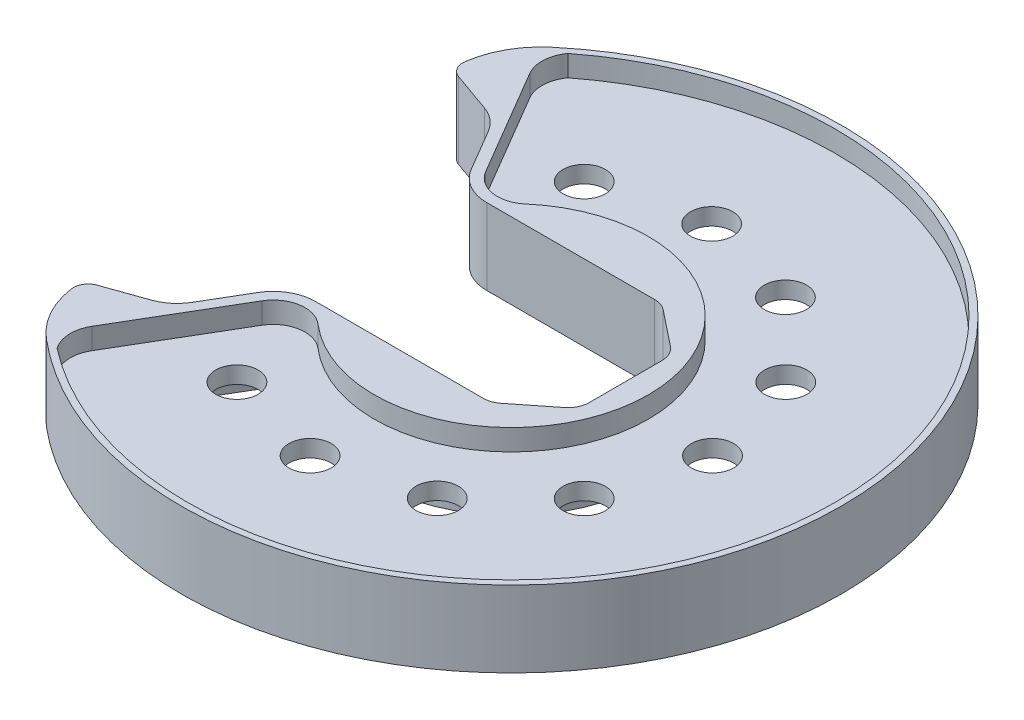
ISO-10303-21;
HEADER;
FILE_DESCRIPTION(('STEP AP214'),'2;1');
FILE_NAME('part.step','',(''),(''),'','','');
FILE_SCHEMA(('AUTOMOTIVE_DESIGN { 1 0 10303 214 1 1 1 1 }'));
ENDSEC;
DATA;
#1=APPLICATION_CONTEXT('core data for automotive mechanical design processes');
#2=APPLICATION_PROTOCOL_DEFINITION('international standard','automotive_design',2000,#1);
#3=PRODUCT_CONTEXT('',#1,'mechanical');
#4=PRODUCT('Part','Part','',(#3));
#5=PRODUCT_RELATED_PRODUCT_CATEGORY('part','',(#4));
#6=PRODUCT_DEFINITION_FORMATION('','',#4);
#7=PRODUCT_DEFINITION_CONTEXT('part definition',#1,'design');
#8=PRODUCT_DEFINITION('design','',#6,#7);
#9=PRODUCT_DEFINITION_SHAPE('','',#8);
#10=(LENGTH_UNIT() NAMED_UNIT(*) SI_UNIT(.MILLI.,.METRE.));
#11=(NAMED_UNIT(*) PLANE_ANGLE_UNIT() SI_UNIT($,.RADIAN.));
#12=(NAMED_UNIT(*) SI_UNIT($,.STERADIAN.) SOLID_ANGLE_UNIT());
#13=UNCERTAINTY_MEASURE_WITH_UNIT(LENGTH_MEASURE(1.E-05),#10,'distance_accuracy_value','');
#14=(GEOMETRIC_REPRESENTATION_CONTEXT(3) GLOBAL_UNCERTAINTY_ASSIGNED_CONTEXT((#13)) GLOBAL_UNIT_ASSIGNED_CONTEXT((#10,
#11,#12)) REPRESENTATION_CONTEXT('',''));
#15=CARTESIAN_POINT('',(0.,0.,0.));
#16=DIRECTION('',(0.,0.,1.));
#17=DIRECTION('',(1.,0.,0.));
#18=AXIS2_PLACEMENT_3D('',#15,#16,#17);
#19=CARTESIAN_POINT('',(-51.559580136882,-16.51,-70.8038124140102));
#20=DIRECTION('',(0.,1.,0.));
#21=DIRECTION('',(0.,0.,-1.));
#22=AXIS2_PLACEMENT_3D('',#19,#20,#21);
#23=CYLINDRICAL_SURFACE('',#22,10.0119999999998);
#24=DIRECTION('',(0.,1.,0.));
#25=VECTOR('',#24,1.);
#26=CARTESIAN_POINT('',(-60.190030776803,-16.51,-65.728828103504));
#27=LINE('',#26,#25);
#28=CARTESIAN_POINT('',(-60.190030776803,-16.51,-65.728828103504));
#29=VERTEX_POINT('',#28);
#30=CARTESIAN_POINT('',(-60.190030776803,-5.08,-65.728828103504));
#31=VERTEX_POINT('',#30);
#32=EDGE_CURVE('E541',#29,#31,#27,.T.);
#33=ORIENTED_EDGE('',*,*,#32,.F.);
#34=CARTESIAN_POINT('',(-51.559580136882,-16.51,-70.8038124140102));
#35=DIRECTION('',(0.,1.,0.));
#36=DIRECTION('',(0.,0.,1.));
#37=AXIS2_PLACEMENT_3D('',#34,#35,#36);
#38=CIRCLE('',#37,10.0119999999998);
#39=CARTESIAN_POINT('',(-59.6737233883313,-16.51,-76.6690339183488));
#40=VERTEX_POINT('',#39);
#41=EDGE_CURVE('E497',#40,#29,#38,.T.);
#42=ORIENTED_EDGE('',*,*,#41,.F.);
#43=DIRECTION('',(0.,1.,0.));
#44=VECTOR('',#43,1.);
#45=CARTESIAN_POINT('',(-59.6737233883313,-16.51,-76.6690339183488));
#46=LINE('',#45,#44);
#47=CARTESIAN_POINT('',(-59.6737233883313,-5.08,-76.6690339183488));
#48=VERTEX_POINT('',#47);
#49=EDGE_CURVE('E520',#40,#48,#46,.T.);
#50=ORIENTED_EDGE('',*,*,#49,.T.);
#51=CARTESIAN_POINT('',(-51.559580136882,-5.08,-70.8038124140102));
#52=DIRECTION('',(0.,-1.,0.));
#53=DIRECTION('',(0.,0.,-1.));
#54=AXIS2_PLACEMENT_3D('',#51,#52,#53);
#55=CIRCLE('',#54,10.0119999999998);
#56=EDGE_CURVE('E494',#31,#48,#55,.T.);
#57=ORIENTED_EDGE('',*,*,#56,.F.);
#58=EDGE_LOOP('',(#33,#42,#50,#57));
#59=FACE_BOUND('',#58,.T.);
#60=ADVANCED_FACE('F35',(#59),#23,.F.);
#61=CARTESIAN_POINT('',(-60.190030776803,-16.51,-65.728828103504));
#62=DIRECTION('',(0.862010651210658,0.,-0.506890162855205));
#63=DIRECTION('',(-0.506890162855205,0.,-0.862010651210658));
#64=AXIS2_PLACEMENT_3D('',#61,#62,#63);
#65=PLANE('',#64);
#66=DIRECTION('',(0.,1.,0.));
#67=VECTOR('',#66,1.);
#68=CARTESIAN_POINT('',(-41.2820936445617,-16.51,-33.5742423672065));
#69=LINE('',#68,#67);
#70=CARTESIAN_POINT('',(-41.2820936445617,-16.51,-33.5742423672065));
#71=VERTEX_POINT('',#70);
#72=CARTESIAN_POINT('',(-41.2820936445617,-5.08,-33.5742423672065));
#73=VERTEX_POINT('',#72);
#74=EDGE_CURVE('E538',#71,#73,#69,.T.);
#75=ORIENTED_EDGE('',*,*,#74,.F.);
#76=DIRECTION('',(0.506890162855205,0.,0.862010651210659));
#77=VECTOR('',#76,1.);
#78=CARTESIAN_POINT('',(-60.190030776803,-16.51,-65.728828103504));
#79=LINE('',#78,#77);
#80=EDGE_CURVE('E500',#29,#71,#79,.T.);
#81=ORIENTED_EDGE('',*,*,#80,.F.);
#82=ORIENTED_EDGE('',*,*,#32,.T.);
#83=DIRECTION('',(-0.506890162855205,0.,-0.862010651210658));
#84=VECTOR('',#83,1.);
#85=CARTESIAN_POINT('',(-60.190030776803,-5.08,-65.728828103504));
#86=LINE('',#85,#84);
#87=EDGE_CURVE('E492',#73,#31,#86,.T.);
#88=ORIENTED_EDGE('',*,*,#87,.F.);
#89=EDGE_LOOP('',(#75,#81,#82,#88));
#90=FACE_BOUND('',#89,.T.);
#91=ADVANCED_FACE('F708',(#90),#65,.T.);
#92=CARTESIAN_POINT('',(-33.0714421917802,-16.51,-38.4023711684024));
#93=DIRECTION('',(0.,1.,0.));
#94=DIRECTION('',(0.,0.,-1.));
#95=AXIS2_PLACEMENT_3D('',#92,#93,#94);
#96=CYLINDRICAL_SURFACE('',#95,9.52500000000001);
#97=DIRECTION('',(0.,1.,0.));
#98=VECTOR('',#97,1.);
#99=CARTESIAN_POINT('',(-26.8558643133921,-16.51,-31.184877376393));
#100=LINE('',#99,#98);
#101=CARTESIAN_POINT('',(-26.8558643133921,-16.51,-31.184877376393));
#102=VERTEX_POINT('',#101);
#103=CARTESIAN_POINT('',(-26.8558643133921,-5.08,-31.184877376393));
#104=VERTEX_POINT('',#103);
#105=EDGE_CURVE('E535',#102,#104,#100,.T.);
#106=ORIENTED_EDGE('',*,*,#105,.F.);
#107=CARTESIAN_POINT('',(-33.0714421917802,-16.51,-38.4023711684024));
#108=DIRECTION('',(0.,1.,0.));
#109=DIRECTION('',(0.,0.,-1.));
#110=AXIS2_PLACEMENT_3D('',#107,#108,#109);
#111=CIRCLE('',#110,9.52500000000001);
#112=EDGE_CURVE('E503',#71,#102,#111,.T.);
#113=ORIENTED_EDGE('',*,*,#112,.F.);
#114=ORIENTED_EDGE('',*,*,#74,.T.);
#115=CARTESIAN_POINT('',(-33.0714421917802,-5.08,-38.4023711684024));
#116=DIRECTION('',(0.,-1.,0.));
#117=DIRECTION('',(0.,0.,-1.));
#118=AXIS2_PLACEMENT_3D('',#115,#116,#117);
#119=CIRCLE('',#118,9.52500000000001);
#120=EDGE_CURVE('E490',#104,#73,#119,.T.);
#121=ORIENTED_EDGE('',*,*,#120,.F.);
#122=EDGE_LOOP('',(#106,#113,#114,#121));
#123=FACE_BOUND('',#122,.T.);
#124=ADVANCED_FACE('F714',(#123),#96,.F.);
#125=CARTESIAN_POINT('',(0.,-16.51,0.));
#126=DIRECTION('',(0.,1.,0.));
#127=DIRECTION('',(0.,0.,-1.));
#128=AXIS2_PLACEMENT_3D('',#125,#126,#127);
#129=CYLINDRICAL_SURFACE('',#128,41.155);
#130=DIRECTION('',(0.,1.,0.));
#131=VECTOR('',#130,1.);
#132=CARTESIAN_POINT('',(-26.8558643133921,-16.51,31.184877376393));
#133=LINE('',#132,#131);
#134=CARTESIAN_POINT('',(-26.8558643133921,-16.51,31.184877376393));
#135=VERTEX_POINT('',#134);
#136=CARTESIAN_POINT('',(-26.8558643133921,-5.08,31.184877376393));
#137=VERTEX_POINT('',#136);
#138=EDGE_CURVE('E532',#135,#137,#133,.T.);
#139=ORIENTED_EDGE('',*,*,#138,.F.);
#140=CARTESIAN_POINT('',(0.,-16.51,0.));
#141=DIRECTION('',(0.,-1.,0.));
#142=DIRECTION('',(0.,0.,-1.));
#143=AXIS2_PLACEMENT_3D('',#140,#141,#142);
#144=CIRCLE('',#143,41.155);
#145=EDGE_CURVE('E506',#102,#135,#144,.T.);
#146=ORIENTED_EDGE('',*,*,#145,.F.);
#147=ORIENTED_EDGE('',*,*,#105,.T.);
#148=CARTESIAN_POINT('',(0.,-5.08,0.));
#149=DIRECTION('',(0.,-1.,0.));
#150=DIRECTION('',(0.,0.,-1.));
#151=AXIS2_PLACEMENT_3D('',#148,#149,#150);
#152=CIRCLE('',#151,41.155);
#153=EDGE_CURVE('E488',#137,#104,#152,.F.);
#154=ORIENTED_EDGE('',*,*,#153,.F.);
#155=EDGE_LOOP('',(#139,#146,#147,#154));
#156=FACE_BOUND('',#155,.T.);
#157=ADVANCED_FACE('F861',(#156),#129,.T.);
#158=CARTESIAN_POINT('',(-33.0714421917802,-16.51,38.4023711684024));
#159=DIRECTION('',(0.,1.,0.));
#160=DIRECTION('',(0.,0.,-1.));
#161=AXIS2_PLACEMENT_3D('',#158,#159,#160);
#162=CYLINDRICAL_SURFACE('',#161,9.52500000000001);
#163=DIRECTION('',(0.,1.,0.));
#164=VECTOR('',#163,1.);
#165=CARTESIAN_POINT('',(-41.2820936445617,-16.51,33.5742423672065));
#166=LINE('',#165,#164);
#167=CARTESIAN_POINT('',(-41.2820936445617,-16.51,33.5742423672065));
#168=VERTEX_POINT('',#167);
#169=CARTESIAN_POINT('',(-41.2820936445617,-5.08,33.5742423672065));
#170=VERTEX_POINT('',#169);
#171=EDGE_CURVE('E529',#168,#170,#166,.T.);
#172=ORIENTED_EDGE('',*,*,#171,.F.);
#173=CARTESIAN_POINT('',(-33.0714421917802,-16.51,38.4023711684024));
#174=DIRECTION('',(0.,1.,0.));
#175=DIRECTION('',(0.,0.,-1.));
#176=AXIS2_PLACEMENT_3D('',#173,#174,#175);
#177=CIRCLE('',#176,9.52500000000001);
#178=EDGE_CURVE('E509',#135,#168,#177,.T.);
#179=ORIENTED_EDGE('',*,*,#178,.F.);
#180=ORIENTED_EDGE('',*,*,#138,.T.);
#181=CARTESIAN_POINT('',(-33.0714421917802,-5.08,38.4023711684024));
#182=DIRECTION('',(0.,-1.,0.));
#183=DIRECTION('',(0.,0.,-1.));
#184=AXIS2_PLACEMENT_3D('',#181,#182,#183);
#185=CIRCLE('',#184,9.52500000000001);
#186=EDGE_CURVE('E486',#170,#137,#185,.T.);
#187=ORIENTED_EDGE('',*,*,#186,.F.);
#188=EDGE_LOOP('',(#172,#179,#180,#187));
#189=FACE_BOUND('',#188,.T.);
#190=ADVANCED_FACE('F857',(#189),#162,.F.);
#191=CARTESIAN_POINT('',(-60.190030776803,-16.51,65.728828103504));
#192=DIRECTION('',(0.862010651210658,0.,0.506890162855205));
#193=DIRECTION('',(0.506890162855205,0.,-0.862010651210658));
#194=AXIS2_PLACEMENT_3D('',#191,#192,#193);
#195=PLANE('',#194);
#196=DIRECTION('',(0.,1.,0.));
#197=VECTOR('',#196,1.);
#198=CARTESIAN_POINT('',(-60.190030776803,-16.51,65.728828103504));
#199=LINE('',#198,#197);
#200=CARTESIAN_POINT('',(-60.190030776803,-16.51,65.728828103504));
#201=VERTEX_POINT('',#200);
#202=CARTESIAN_POINT('',(-60.190030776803,-5.08,65.728828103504));
#203=VERTEX_POINT('',#202);
#204=EDGE_CURVE('E526',#201,#203,#199,.T.);
#205=ORIENTED_EDGE('',*,*,#204,.F.);
#206=DIRECTION('',(-0.506890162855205,0.,0.862010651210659));
#207=VECTOR('',#206,1.);
#208=CARTESIAN_POINT('',(-60.190030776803,-16.51,65.728828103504));
#209=LINE('',#208,#207);
#210=EDGE_CURVE('E512',#168,#201,#209,.T.);
#211=ORIENTED_EDGE('',*,*,#210,.F.);
#212=ORIENTED_EDGE('',*,*,#171,.T.);
#213=DIRECTION('',(0.506890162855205,0.,-0.862010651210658));
#214=VECTOR('',#213,1.);
#215=CARTESIAN_POINT('',(-60.190030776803,-5.08,65.728828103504));
#216=LINE('',#215,#214);
#217=EDGE_CURVE('E484',#203,#170,#216,.T.);
#218=ORIENTED_EDGE('',*,*,#217,.F.);
#219=EDGE_LOOP('',(#205,#211,#212,#218));
#220=FACE_BOUND('',#219,.T.);
#221=ADVANCED_FACE('F853',(#220),#195,.T.);
#222=CARTESIAN_POINT('',(-51.559580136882,-16.51,70.8038124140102));
#223=DIRECTION('',(0.,1.,0.));
#224=DIRECTION('',(0.,0.,-1.));
#225=AXIS2_PLACEMENT_3D('',#222,#223,#224);
#226=CYLINDRICAL_SURFACE('',#225,10.0119999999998);
#227=DIRECTION('',(0.,1.,0.));
#228=VECTOR('',#227,1.);
#229=CARTESIAN_POINT('',(-59.6737233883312,-16.51,76.6690339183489));
#230=LINE('',#229,#228);
#231=CARTESIAN_POINT('',(-59.6737233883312,-16.51,76.6690339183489));
#232=VERTEX_POINT('',#231);
#233=CARTESIAN_POINT('',(-59.6737233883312,-5.08,76.6690339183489));
#234=VERTEX_POINT('',#233);
#235=EDGE_CURVE('E523',#232,#234,#230,.T.);
#236=ORIENTED_EDGE('',*,*,#235,.F.);
#237=CARTESIAN_POINT('',(-51.559580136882,-16.51,70.8038124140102));
#238=DIRECTION('',(0.,1.,0.));
#239=DIRECTION('',(0.,0.,-1.));
#240=AXIS2_PLACEMENT_3D('',#237,#238,#239);
#241=CIRCLE('',#240,10.0119999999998);
#242=EDGE_CURVE('E515',#201,#232,#241,.T.);
#243=ORIENTED_EDGE('',*,*,#242,.F.);
#244=ORIENTED_EDGE('',*,*,#204,.T.);
#245=CARTESIAN_POINT('',(-51.559580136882,-5.08,70.8038124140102));
#246=DIRECTION('',(0.,-1.,0.));
#247=DIRECTION('',(0.,0.,-1.));
#248=AXIS2_PLACEMENT_3D('',#245,#246,#247);
#249=CIRCLE('',#248,10.0119999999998);
#250=EDGE_CURVE('E477',#234,#203,#249,.T.);
#251=ORIENTED_EDGE('',*,*,#250,.F.);
#252=EDGE_LOOP('',(#236,#243,#244,#251));
#253=FACE_BOUND('',#252,.T.);
#254=ADVANCED_FACE('F849',(#253),#226,.F.);
#255=CARTESIAN_POINT('',(0.,-16.51,0.));
#256=DIRECTION('',(0.,1.,0.));
#257=DIRECTION('',(0.,0.,-1.));
#258=AXIS2_PLACEMENT_3D('',#255,#256,#257);
#259=CYLINDRICAL_SURFACE('',#258,97.155);
#260=ORIENTED_EDGE('',*,*,#49,.F.);
#261=CARTESIAN_POINT('',(0.,-16.51,0.));
#262=DIRECTION('',(0.,1.,0.));
#263=DIRECTION('',(0.,0.,-1.));
#264=AXIS2_PLACEMENT_3D('',#261,#262,#263);
#265=CIRCLE('',#264,97.155);
#266=EDGE_CURVE('E518',#232,#40,#265,.T.);
#267=ORIENTED_EDGE('',*,*,#266,.F.);
#268=ORIENTED_EDGE('',*,*,#235,.T.);
#269=CARTESIAN_POINT('',(0.,-5.08,0.));
#270=DIRECTION('',(0.,-1.,0.));
#271=DIRECTION('',(0.,0.,-1.));
#272=AXIS2_PLACEMENT_3D('',#269,#270,#271);
#273=CIRCLE('',#272,97.155);
#274=EDGE_CURVE('E581',#48,#234,#273,.T.);
#275=ORIENTED_EDGE('',*,*,#274,.F.);
#276=EDGE_LOOP('',(#260,#267,#268,#275));
#277=FACE_BOUND('',#276,.T.);
#278=ADVANCED_FACE('F721',(#277),#259,.F.);
#279=CARTESIAN_POINT('',(-33.0714421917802,-16.51,-38.4023711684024));
#280=DIRECTION('',(0.,-1.,0.));
#281=DIRECTION('',(0.,0.,1.));
#282=AXIS2_PLACEMENT_3D('',#279,#280,#281);
#283=PLANE('',#282);
#284=CARTESIAN_POINT('',(-68.58,-16.51,-58.42));
#285=DIRECTION('',(0.,1.,0.));
#286=DIRECTION('',(0.,0.,1.));
#287=AXIS2_PLACEMENT_3D('',#284,#285,#286);
#288=CIRCLE('',#287,2.45745);
#289=CARTESIAN_POINT('',(-68.58,-16.51,-55.96255));
#290=VERTEX_POINT('',#289);
#291=EDGE_CURVE('E419',#290,#290,#288,.T.);
#292=ORIENTED_EDGE('',*,*,#291,.T.);
#293=EDGE_LOOP('',(#292));
#294=FACE_BOUND('',#293,.T.);
#295=CARTESIAN_POINT('',(-68.58,-16.51,58.42));
#296=DIRECTION('',(0.,1.,0.));
#297=DIRECTION('',(0.,0.,1.));
#298=AXIS2_PLACEMENT_3D('',#295,#296,#297);
#299=CIRCLE('',#298,2.45745);
#300=CARTESIAN_POINT('',(-68.58,-16.51,60.87745));
#301=VERTEX_POINT('',#300);
#302=EDGE_CURVE('E422',#301,#301,#299,.T.);
#303=ORIENTED_EDGE('',*,*,#302,.T.);
#304=EDGE_LOOP('',(#303));
#305=FACE_BOUND('',#304,.T.);
#306=CARTESIAN_POINT('',(14.7983753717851,-16.51,32.0523711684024));
#307=DIRECTION('',(0.,1.,0.));
#308=DIRECTION('',(0.,0.,1.));
#309=AXIS2_PLACEMENT_3D('',#306,#307,#308);
#310=CIRCLE('',#309,2.45745);
#311=CARTESIAN_POINT('',(14.7983753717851,-16.51,34.5098211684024));
#312=VERTEX_POINT('',#311);
#313=EDGE_CURVE('E429',#312,#312,#310,.T.);
#314=ORIENTED_EDGE('',*,*,#313,.T.);
#315=EDGE_LOOP('',(#314));
#316=FACE_BOUND('',#315,.T.);
#317=CARTESIAN_POINT('',(14.7983753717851,-16.51,-32.0523711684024));
#318=DIRECTION('',(0.,1.,0.));
#319=DIRECTION('',(0.,0.,1.));
#320=AXIS2_PLACEMENT_3D('',#317,#318,#319);
#321=CIRCLE('',#320,2.45745);
#322=CARTESIAN_POINT('',(14.7983753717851,-16.51,-29.5949211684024));
#323=VERTEX_POINT('',#322);
#324=EDGE_CURVE('E435',#323,#323,#321,.T.);
#325=ORIENTED_EDGE('',*,*,#324,.T.);
#326=EDGE_LOOP('',(#325));
#327=FACE_BOUND('',#326,.T.);
#328=CARTESIAN_POINT('',(-62.3081755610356,-16.51,-38.0124949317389));
#329=DIRECTION('',(0.,-1.,0.));
#330=DIRECTION('',(0.,0.,-1.));
#331=AXIS2_PLACEMENT_3D('',#328,#329,#330);
#332=CIRCLE('',#331,12.7);
#333=CARTESIAN_POINT('',(-58.0703499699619,-16.51,-49.9845805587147));
#334=VERTEX_POINT('',#333);
#335=CARTESIAN_POINT('',(-51.3606402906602,-16.51,-44.45));
#336=VERTEX_POINT('',#335);
#337=EDGE_CURVE('E471',#334,#336,#332,.T.);
#338=ORIENTED_EDGE('',*,*,#337,.F.);
#339=DIRECTION('',(0.94268390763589,0.,0.333687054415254));
#340=VECTOR('',#339,1.);
#341=CARTESIAN_POINT('',(-70.0632389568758,-16.51,-54.2297700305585));
#342=LINE('',#341,#340);
#343=CARTESIAN_POINT('',(-70.0632389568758,-16.51,-54.2297700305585));
#344=VERTEX_POINT('',#343);
#345=EDGE_CURVE('E468',#344,#334,#342,.T.);
#346=ORIENTED_EDGE('',*,*,#345,.F.);
#347=CARTESIAN_POINT('',(-68.58,-16.51,-58.42));
#348=DIRECTION('',(0.,1.,0.));
#349=DIRECTION('',(0.,0.,1.));
#350=AXIS2_PLACEMENT_3D('',#347,#348,#349);
#351=CIRCLE('',#350,4.445);
#352=CARTESIAN_POINT('',(-72.9842416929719,-16.51,-59.0205664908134));
#353=VERTEX_POINT('',#352);
#354=EDGE_CURVE('E465',#353,#344,#351,.T.);
#355=ORIENTED_EDGE('',*,*,#354,.F.);
#356=CARTESIAN_POINT('',(-46.5184478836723,-16.51,-55.4116662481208));
#357=DIRECTION('',(0.,1.,0.));
#358=DIRECTION('',(0.,0.,-1.));
#359=AXIS2_PLACEMENT_3D('',#356,#357,#358);
#360=CIRCLE('',#359,26.7107170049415);
#361=CARTESIAN_POINT('',(-63.6926484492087,-16.51,-75.8691645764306));
#362=VERTEX_POINT('',#361);
#363=EDGE_CURVE('E457',#362,#353,#360,.T.);
#364=ORIENTED_EDGE('',*,*,#363,.F.);
#365=CARTESIAN_POINT('',(0.,-16.51,0.));
#366=DIRECTION('',(0.,1.,0.));
#367=DIRECTION('',(0.,0.,1.));
#368=AXIS2_PLACEMENT_3D('',#365,#366,#367);
#369=CIRCLE('',#368,99.06);
#370=CARTESIAN_POINT('',(-63.6926484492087,-16.51,75.8691645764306));
#371=VERTEX_POINT('',#370);
#372=EDGE_CURVE('E556',#371,#362,#369,.T.);
#373=ORIENTED_EDGE('',*,*,#372,.F.);
#374=CARTESIAN_POINT('',(-46.5184478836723,-16.51,55.4116662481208));
#375=DIRECTION('',(0.,-1.,0.));
#376=DIRECTION('',(0.,0.,1.));
#377=AXIS2_PLACEMENT_3D('',#374,#375,#376);
#378=CIRCLE('',#377,26.7107170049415);
#379=CARTESIAN_POINT('',(-72.9842416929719,-16.51,59.0205664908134));
#380=VERTEX_POINT('',#379);
#381=EDGE_CURVE('E451',#371,#380,#378,.T.);
#382=ORIENTED_EDGE('',*,*,#381,.T.);
#383=CARTESIAN_POINT('',(-68.58,-16.51,58.42));
#384=DIRECTION('',(0.,-1.,0.));
#385=DIRECTION('',(0.,0.,-1.));
#386=AXIS2_PLACEMENT_3D('',#383,#384,#385);
#387=CIRCLE('',#386,4.445);
#388=CARTESIAN_POINT('',(-70.0632389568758,-16.51,54.2297700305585));
#389=VERTEX_POINT('',#388);
#390=EDGE_CURVE('E448',#380,#389,#387,.T.);
#391=ORIENTED_EDGE('',*,*,#390,.T.);
#392=DIRECTION('',(0.94268390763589,0.,-0.333687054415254));
#393=VECTOR('',#392,1.);
#394=CARTESIAN_POINT('',(-70.0632389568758,-16.51,54.2297700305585));
#395=LINE('',#394,#393);
#396=CARTESIAN_POINT('',(-58.0703499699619,-16.51,49.9845805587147));
#397=VERTEX_POINT('',#396);
#398=EDGE_CURVE('E445',#389,#397,#395,.T.);
#399=ORIENTED_EDGE('',*,*,#398,.T.);
#400=CARTESIAN_POINT('',(-62.3081755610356,-16.51,38.0124949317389));
#401=DIRECTION('',(0.,1.,0.));
#402=DIRECTION('',(0.,0.,1.));
#403=AXIS2_PLACEMENT_3D('',#400,#401,#402);
#404=CIRCLE('',#403,12.7);
#405=CARTESIAN_POINT('',(-51.3606402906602,-16.51,44.45));
#406=VERTEX_POINT('',#405);
#407=EDGE_CURVE('E440',#397,#406,#404,.T.);
#408=ORIENTED_EDGE('',*,*,#407,.T.);
#409=DIRECTION('',(-0.506890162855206,0.,0.862010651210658));
#410=VECTOR('',#409,1.);
#411=CARTESIAN_POINT('',(-67.730120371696,-16.51,72.2877195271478));
#412=LINE('',#411,#410);
#413=CARTESIAN_POINT('',(-44.0189774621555,-16.51,31.9648661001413));
#414=VERTEX_POINT('',#413);
#415=EDGE_CURVE('E553',#414,#406,#412,.T.);
#416=ORIENTED_EDGE('',*,*,#415,.F.);
#417=CARTESIAN_POINT('',(-33.0714421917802,-16.51,38.4023711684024));
#418=DIRECTION('',(0.,1.,0.));
#419=DIRECTION('',(0.,0.,-1.));
#420=AXIS2_PLACEMENT_3D('',#417,#418,#419);
#421=CIRCLE('',#420,12.7);
#422=CARTESIAN_POINT('',(-33.0714421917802,-16.51,25.7023711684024));
#423=VERTEX_POINT('',#422);
#424=EDGE_CURVE('E550',#423,#414,#421,.T.);
#425=ORIENTED_EDGE('',*,*,#424,.F.);
#426=DIRECTION('',(-1.,0.,0.));
#427=VECTOR('',#426,1.);
#428=CARTESIAN_POINT('',(19.5169095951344,-16.51,25.7023711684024));
#429=LINE('',#428,#427);
#430=CARTESIAN_POINT('',(17.302149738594,-16.51,25.7023711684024));
#431=VERTEX_POINT('',#430);
#432=EDGE_CURVE('E547',#431,#423,#429,.T.);
#433=ORIENTED_EDGE('',*,*,#432,.F.);
#434=CARTESIAN_POINT('',(17.302149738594,-16.51,19.3523711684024));
#435=DIRECTION('',(0.,1.,0.));
#436=DIRECTION('',(0.,0.,1.));
#437=AXIS2_PLACEMENT_3D('',#434,#435,#436);
#438=CIRCLE('',#437,6.35);
#439=CARTESIAN_POINT('',(21.2512663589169,-16.51,24.324994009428));
#440=VERTEX_POINT('',#439);
#441=EDGE_CURVE('E602',#440,#431,#438,.F.);
#442=ORIENTED_EDGE('',*,*,#441,.F.);
#443=DIRECTION('',(-0.783090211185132,0.,0.62190812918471));
#444=VECTOR('',#443,1.);
#445=CARTESIAN_POINT('',(19.5169095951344,-16.51,25.7023711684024));
#446=LINE('',#445,#444);
#447=CARTESIAN_POINT('',(31.8891166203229,-16.51,15.8767137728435));
#448=VERTEX_POINT('',#447);
#449=EDGE_CURVE('E544',#448,#440,#446,.T.);
#450=ORIENTED_EDGE('',*,*,#449,.F.);
#451=CARTESIAN_POINT('',(27.94,-16.51,10.904090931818));
#452=DIRECTION('',(0.,1.,0.));
#453=DIRECTION('',(0.,0.,1.));
#454=AXIS2_PLACEMENT_3D('',#451,#452,#453);
#455=CIRCLE('',#454,6.35);
#456=CARTESIAN_POINT('',(34.29,-16.51,10.904090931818));
#457=VERTEX_POINT('',#456);
#458=EDGE_CURVE('E43',#457,#448,#455,.F.);
#459=ORIENTED_EDGE('',*,*,#458,.F.);
#460=DIRECTION('',(0.,0.,1.));
#461=VECTOR('',#460,1.);
#462=CARTESIAN_POINT('',(34.29,-16.51,13.97));
#463=LINE('',#462,#461);
#464=CARTESIAN_POINT('',(34.29,-16.51,-10.904090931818));
#465=VERTEX_POINT('',#464);
#466=EDGE_CURVE('E571',#465,#457,#463,.T.);
#467=ORIENTED_EDGE('',*,*,#466,.F.);
#468=CARTESIAN_POINT('',(27.94,-16.51,-10.904090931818));
#469=DIRECTION('',(0.,1.,0.));
#470=DIRECTION('',(0.,0.,1.));
#471=AXIS2_PLACEMENT_3D('',#468,#469,#470);
#472=CIRCLE('',#471,6.35);
#473=CARTESIAN_POINT('',(31.8891166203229,-16.51,-15.8767137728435));
#474=VERTEX_POINT('',#473);
#475=EDGE_CURVE('E11',#474,#465,#472,.F.);
#476=ORIENTED_EDGE('',*,*,#475,.F.);
#477=DIRECTION('',(0.783090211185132,0.,0.62190812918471));
#478=VECTOR('',#477,1.);
#479=CARTESIAN_POINT('',(19.5169095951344,-16.51,-25.7023711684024));
#480=LINE('',#479,#478);
#481=CARTESIAN_POINT('',(21.2512663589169,-16.51,-24.324994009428));
#482=VERTEX_POINT('',#481);
#483=EDGE_CURVE('E568',#482,#474,#480,.T.);
#484=ORIENTED_EDGE('',*,*,#483,.F.);
#485=CARTESIAN_POINT('',(17.302149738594,-16.51,-19.3523711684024));
#486=DIRECTION('',(0.,1.,0.));
#487=DIRECTION('',(0.,0.,1.));
#488=AXIS2_PLACEMENT_3D('',#485,#486,#487);
#489=CIRCLE('',#488,6.35);
#490=CARTESIAN_POINT('',(17.302149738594,-16.51,-25.7023711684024));
#491=VERTEX_POINT('',#490);
#492=EDGE_CURVE('E605',#491,#482,#489,.F.);
#493=ORIENTED_EDGE('',*,*,#492,.F.);
#494=DIRECTION('',(1.,0.,0.));
#495=VECTOR('',#494,1.);
#496=CARTESIAN_POINT('',(19.5169095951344,-16.51,-25.7023711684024));
#497=LINE('',#496,#495);
#498=CARTESIAN_POINT('',(-33.0714421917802,-16.51,-25.7023711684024));
#499=VERTEX_POINT('',#498);
#500=EDGE_CURVE('E565',#499,#491,#497,.T.);
#501=ORIENTED_EDGE('',*,*,#500,.F.);
#502=CARTESIAN_POINT('',(-33.0714421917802,-16.51,-38.4023711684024));
#503=DIRECTION('',(0.,1.,0.));
#504=DIRECTION('',(0.,0.,1.));
#505=AXIS2_PLACEMENT_3D('',#502,#503,#504);
#506=CIRCLE('',#505,12.7);
#507=CARTESIAN_POINT('',(-44.0189774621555,-16.51,-31.9648661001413));
#508=VERTEX_POINT('',#507);
#509=EDGE_CURVE('E562',#508,#499,#506,.T.);
#510=ORIENTED_EDGE('',*,*,#509,.F.);
#511=DIRECTION('',(0.506890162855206,0.,0.862010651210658));
#512=VECTOR('',#511,1.);
#513=CARTESIAN_POINT('',(-67.730120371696,-16.51,-72.2877195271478));
#514=LINE('',#513,#512);
#515=EDGE_CURVE('E559',#336,#508,#514,.T.);
#516=ORIENTED_EDGE('',*,*,#515,.F.);
#517=EDGE_LOOP('',(#338,#346,#355,#364,#373,#382,#391,#399,#408,#416,#425,#433,#442,#450,#459,
#467,#476,#484,#493,#501,#510,#516));
#518=FACE_BOUND('',#517,.T.);
#519=ORIENTED_EDGE('',*,*,#80,.T.);
#520=ORIENTED_EDGE('',*,*,#112,.T.);
#521=ORIENTED_EDGE('',*,*,#145,.T.);
#522=ORIENTED_EDGE('',*,*,#178,.T.);
#523=ORIENTED_EDGE('',*,*,#210,.T.);
#524=ORIENTED_EDGE('',*,*,#242,.T.);
#525=ORIENTED_EDGE('',*,*,#266,.T.);
#526=ORIENTED_EDGE('',*,*,#41,.T.);
#527=EDGE_LOOP('',(#519,#520,#521,#522,#523,#524,#525,#526));
#528=FACE_BOUND('',#527,.T.);
#529=ADVANCED_FACE('F614',(#294,#305,#316,#327,#518,#528),#283,.T.);
#530=CARTESIAN_POINT('',(19.5169095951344,-16.51,25.7023711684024));
#531=DIRECTION('',(0.62190812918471,0.,0.783090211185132));
#532=DIRECTION('',(0.783090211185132,0.,-0.62190812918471));
#533=AXIS2_PLACEMENT_3D('',#530,#531,#532);
#534=PLANE('',#533);
#535=DIRECTION('',(0.,1.,0.));
#536=VECTOR('',#535,1.);
#537=CARTESIAN_POINT('',(21.2512663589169,-16.51,24.324994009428));
#538=LINE('',#537,#536);
#539=CARTESIAN_POINT('',(21.2512663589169,6.35,24.324994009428));
#540=VERTEX_POINT('',#539);
#541=EDGE_CURVE('E587',#540,#440,#538,.F.);
#542=ORIENTED_EDGE('',*,*,#541,.F.);
#543=DIRECTION('',(-0.783090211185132,0.,0.62190812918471));
#544=VECTOR('',#543,1.);
#545=CARTESIAN_POINT('',(31.8891166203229,6.35,15.8767137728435));
#546=LINE('',#545,#544);
#547=CARTESIAN_POINT('',(31.8891166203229,6.35,15.8767137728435));
#548=VERTEX_POINT('',#547);
#549=EDGE_CURVE('E403',#548,#540,#546,.T.);
#550=ORIENTED_EDGE('',*,*,#549,.F.);
#551=DIRECTION('',(0.,1.,0.));
#552=VECTOR('',#551,1.);
#553=CARTESIAN_POINT('',(31.8891166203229,0.,15.8767137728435));
#554=LINE('',#553,#552);
#555=EDGE_CURVE('E585',#448,#548,#554,.T.);
#556=ORIENTED_EDGE('',*,*,#555,.F.);
#557=ORIENTED_EDGE('',*,*,#449,.T.);
#558=EDGE_LOOP('',(#542,#550,#556,#557));
#559=FACE_BOUND('',#558,.T.);
#560=ADVANCED_FACE('F618',(#559),#534,.F.);
#561=CARTESIAN_POINT('',(19.5169095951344,-16.51,25.7023711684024));
#562=DIRECTION('',(0.,0.,1.));
#563=DIRECTION('',(1.,0.,0.));
#564=AXIS2_PLACEMENT_3D('',#561,#562,#563);
#565=PLANE('',#564);
#566=ORIENTED_EDGE('',*,*,#432,.T.);
#567=DIRECTION('',(0.,1.,0.));
#568=VECTOR('',#567,1.);
#569=CARTESIAN_POINT('',(-33.0714421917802,-16.51,25.7023711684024));
#570=LINE('',#569,#568);
#571=CARTESIAN_POINT('',(-33.0714421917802,6.35,25.7023711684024));
#572=VERTEX_POINT('',#571);
#573=EDGE_CURVE('E579',#423,#572,#570,.T.);
#574=ORIENTED_EDGE('',*,*,#573,.T.);
#575=DIRECTION('',(-1.,0.,0.));
#576=VECTOR('',#575,1.);
#577=CARTESIAN_POINT('',(17.302149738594,6.35,25.7023711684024));
#578=LINE('',#577,#576);
#579=CARTESIAN_POINT('',(17.302149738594,6.35,25.7023711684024));
#580=VERTEX_POINT('',#579);
#581=EDGE_CURVE('E409',#580,#572,#578,.T.);
#582=ORIENTED_EDGE('',*,*,#581,.F.);
#583=DIRECTION('',(0.,1.,0.));
#584=VECTOR('',#583,1.);
#585=CARTESIAN_POINT('',(17.302149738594,0.,25.7023711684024));
#586=LINE('',#585,#584);
#587=EDGE_CURVE('E583',#431,#580,#586,.T.);
#588=ORIENTED_EDGE('',*,*,#587,.F.);
#589=EDGE_LOOP('',(#566,#574,#582,#588));
#590=FACE_BOUND('',#589,.T.);
#591=ADVANCED_FACE('F626',(#590),#565,.F.);
#592=CARTESIAN_POINT('',(-33.0714421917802,-16.51,38.4023711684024));
#593=DIRECTION('',(0.,1.,0.));
#594=DIRECTION('',(0.,0.,-1.));
#595=AXIS2_PLACEMENT_3D('',#592,#593,#594);
#596=CYLINDRICAL_SURFACE('',#595,12.7);
#597=DIRECTION('',(0.,1.,0.));
#598=VECTOR('',#597,1.);
#599=CARTESIAN_POINT('',(-44.0189774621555,-16.51,31.9648661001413));
#600=LINE('',#599,#598);
#601=CARTESIAN_POINT('',(-44.0189774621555,6.35,31.9648661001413));
#602=VERTEX_POINT('',#601);
#603=EDGE_CURVE('E577',#414,#602,#600,.T.);
#604=ORIENTED_EDGE('',*,*,#603,.T.);
#605=CARTESIAN_POINT('',(-33.0714421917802,6.35,38.4023711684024));
#606=DIRECTION('',(0.,1.,0.));
#607=DIRECTION('',(0.,0.,1.));
#608=AXIS2_PLACEMENT_3D('',#605,#606,#607);
#609=CIRCLE('',#608,12.7);
#610=EDGE_CURVE('E412',#572,#602,#609,.T.);
#611=ORIENTED_EDGE('',*,*,#610,.F.);
#612=ORIENTED_EDGE('',*,*,#573,.F.);
#613=ORIENTED_EDGE('',*,*,#424,.T.);
#614=EDGE_LOOP('',(#604,#611,#612,#613));
#615=FACE_BOUND('',#614,.T.);
#616=ADVANCED_FACE('F631',(#615),#596,.T.);
#617=CARTESIAN_POINT('',(-67.730120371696,-16.51,72.2877195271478));
#618=DIRECTION('',(0.862010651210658,0.,0.506890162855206));
#619=DIRECTION('',(0.506890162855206,0.,-0.862010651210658));
#620=AXIS2_PLACEMENT_3D('',#617,#618,#619);
#621=PLANE('',#620);
#622=DIRECTION('',(0.,-1.,0.));
#623=VECTOR('',#622,1.);
#624=CARTESIAN_POINT('',(-51.3606402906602,38.1642291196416,44.45));
#625=LINE('',#624,#623);
#626=CARTESIAN_POINT('',(-51.3606402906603,6.35,44.45));
#627=VERTEX_POINT('',#626);
#628=EDGE_CURVE('E454',#627,#406,#625,.T.);
#629=ORIENTED_EDGE('',*,*,#628,.F.);
#630=DIRECTION('',(-0.506890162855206,0.,0.862010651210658));
#631=VECTOR('',#630,1.);
#632=CARTESIAN_POINT('',(-44.0189774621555,6.35,31.9648661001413));
#633=LINE('',#632,#631);
#634=EDGE_CURVE('E415',#602,#627,#633,.T.);
#635=ORIENTED_EDGE('',*,*,#634,.F.);
#636=ORIENTED_EDGE('',*,*,#603,.F.);
#637=ORIENTED_EDGE('',*,*,#415,.T.);
#638=EDGE_LOOP('',(#629,#635,#636,#637));
#639=FACE_BOUND('',#638,.T.);
#640=ADVANCED_FACE('F634',(#639),#621,.F.);
#641=CARTESIAN_POINT('',(0.,-16.51,0.));
#642=DIRECTION('',(0.,1.,0.));
#643=DIRECTION('',(0.,0.,-1.));
#644=AXIS2_PLACEMENT_3D('',#641,#642,#643);
#645=CYLINDRICAL_SURFACE('',#644,99.06);
#646=ORIENTED_EDGE('',*,*,#372,.T.);
#647=DIRECTION('',(0.,1.,0.));
#648=VECTOR('',#647,1.);
#649=CARTESIAN_POINT('',(-63.6926484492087,-16.51,-75.8691645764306));
#650=LINE('',#649,#648);
#651=CARTESIAN_POINT('',(-63.6926484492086,6.35,-75.8691645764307));
#652=VERTEX_POINT('',#651);
#653=EDGE_CURVE('E595',#652,#362,#650,.F.);
#654=ORIENTED_EDGE('',*,*,#653,.F.);
#655=CARTESIAN_POINT('',(0.,6.35,0.));
#656=DIRECTION('',(0.,1.,0.));
#657=DIRECTION('',(0.,0.,1.));
#658=AXIS2_PLACEMENT_3D('',#655,#656,#657);
#659=CIRCLE('',#658,99.06);
#660=CARTESIAN_POINT('',(-63.6926484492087,6.35,75.8691645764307));
#661=VERTEX_POINT('',#660);
#662=EDGE_CURVE('E364',#661,#652,#659,.T.);
#663=ORIENTED_EDGE('',*,*,#662,.F.);
#664=DIRECTION('',(0.,1.,0.));
#665=VECTOR('',#664,1.);
#666=CARTESIAN_POINT('',(-63.6926484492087,-16.51,75.8691645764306));
#667=LINE('',#666,#665);
#668=EDGE_CURVE('E597',#371,#661,#667,.T.);
#669=ORIENTED_EDGE('',*,*,#668,.F.);
#670=EDGE_LOOP('',(#646,#654,#663,#669));
#671=FACE_BOUND('',#670,.T.);
#672=ADVANCED_FACE('F655',(#671),#645,.T.);
#673=CARTESIAN_POINT('',(-67.730120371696,-16.51,-72.2877195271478));
#674=DIRECTION('',(0.862010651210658,0.,-0.506890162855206));
#675=DIRECTION('',(-0.506890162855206,0.,-0.862010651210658));
#676=AXIS2_PLACEMENT_3D('',#673,#674,#675);
#677=PLANE('',#676);
#678=ORIENTED_EDGE('',*,*,#515,.T.);
#679=DIRECTION('',(0.,1.,0.));
#680=VECTOR('',#679,1.);
#681=CARTESIAN_POINT('',(-44.0189774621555,-16.51,-31.9648661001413));
#682=LINE('',#681,#680);
#683=CARTESIAN_POINT('',(-44.0189774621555,6.35,-31.9648661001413));
#684=VERTEX_POINT('',#683);
#685=EDGE_CURVE('E575',#508,#684,#682,.T.);
#686=ORIENTED_EDGE('',*,*,#685,.T.);
#687=DIRECTION('',(0.506890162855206,0.,0.862010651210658));
#688=VECTOR('',#687,1.);
#689=CARTESIAN_POINT('',(-51.3606402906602,6.35,-44.45));
#690=LINE('',#689,#688);
#691=CARTESIAN_POINT('',(-51.3606402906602,6.35,-44.45));
#692=VERTEX_POINT('',#691);
#693=EDGE_CURVE('E379',#692,#684,#690,.T.);
#694=ORIENTED_EDGE('',*,*,#693,.F.);
#695=DIRECTION('',(0.,-1.,0.));
#696=VECTOR('',#695,1.);
#697=CARTESIAN_POINT('',(-51.3606402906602,38.1642291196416,-44.45));
#698=LINE('',#697,#696);
#699=EDGE_CURVE('E475',#692,#336,#698,.T.);
#700=ORIENTED_EDGE('',*,*,#699,.T.);
#701=EDGE_LOOP('',(#678,#686,#694,#700));
#702=FACE_BOUND('',#701,.T.);
#703=ADVANCED_FACE('F673',(#702),#677,.F.);
#704=CARTESIAN_POINT('',(-33.0714421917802,-16.51,-38.4023711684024));
#705=DIRECTION('',(0.,1.,0.));
#706=DIRECTION('',(0.,0.,-1.));
#707=AXIS2_PLACEMENT_3D('',#704,#705,#706);
#708=CYLINDRICAL_SURFACE('',#707,12.7);
#709=DIRECTION('',(0.,1.,0.));
#710=VECTOR('',#709,1.);
#711=CARTESIAN_POINT('',(-33.0714421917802,-16.51,-25.7023711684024));
#712=LINE('',#711,#710);
#713=CARTESIAN_POINT('',(-33.0714421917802,6.35,-25.7023711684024));
#714=VERTEX_POINT('',#713);
#715=EDGE_CURVE('E573',#499,#714,#712,.T.);
#716=ORIENTED_EDGE('',*,*,#715,.T.);
#717=CARTESIAN_POINT('',(-33.0714421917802,6.35,-38.4023711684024));
#718=DIRECTION('',(0.,1.,0.));
#719=DIRECTION('',(0.,0.,1.));
#720=AXIS2_PLACEMENT_3D('',#717,#718,#719);
#721=CIRCLE('',#720,12.7);
#722=EDGE_CURVE('E382',#684,#714,#721,.T.);
#723=ORIENTED_EDGE('',*,*,#722,.F.);
#724=ORIENTED_EDGE('',*,*,#685,.F.);
#725=ORIENTED_EDGE('',*,*,#509,.T.);
#726=EDGE_LOOP('',(#716,#723,#724,#725));
#727=FACE_BOUND('',#726,.T.);
#728=ADVANCED_FACE('F678',(#727),#708,.T.);
#729=CARTESIAN_POINT('',(19.5169095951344,-16.51,-25.7023711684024));
#730=DIRECTION('',(0.,0.,-1.));
#731=DIRECTION('',(-1.,0.,0.));
#732=AXIS2_PLACEMENT_3D('',#729,#730,#731);
#733=PLANE('',#732);
#734=DIRECTION('',(0.,1.,0.));
#735=VECTOR('',#734,1.);
#736=CARTESIAN_POINT('',(17.302149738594,-16.51,-25.7023711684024));
#737=LINE('',#736,#735);
#738=CARTESIAN_POINT('',(17.302149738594,6.35,-25.7023711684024));
#739=VERTEX_POINT('',#738);
#740=EDGE_CURVE('E593',#739,#491,#737,.F.);
#741=ORIENTED_EDGE('',*,*,#740,.F.);
#742=DIRECTION('',(1.,0.,0.));
#743=VECTOR('',#742,1.);
#744=CARTESIAN_POINT('',(-33.0714421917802,6.35,-25.7023711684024));
#745=LINE('',#744,#743);
#746=EDGE_CURVE('E385',#714,#739,#745,.T.);
#747=ORIENTED_EDGE('',*,*,#746,.F.);
#748=ORIENTED_EDGE('',*,*,#715,.F.);
#749=ORIENTED_EDGE('',*,*,#500,.T.);
#750=EDGE_LOOP('',(#741,#747,#748,#749));
#751=FACE_BOUND('',#750,.T.);
#752=ADVANCED_FACE('F683',(#751),#733,.F.);
#753=CARTESIAN_POINT('',(19.5169095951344,-16.51,-25.7023711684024));
#754=DIRECTION('',(0.62190812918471,0.,-0.783090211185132));
#755=DIRECTION('',(-0.783090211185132,0.,-0.62190812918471));
#756=AXIS2_PLACEMENT_3D('',#753,#754,#755);
#757=PLANE('',#756);
#758=ORIENTED_EDGE('',*,*,#483,.T.);
#759=DIRECTION('',(0.,1.,0.));
#760=VECTOR('',#759,1.);
#761=CARTESIAN_POINT('',(31.8891166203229,-16.51,-15.8767137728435));
#762=LINE('',#761,#760);
#763=CARTESIAN_POINT('',(31.8891166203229,6.35,-15.8767137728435));
#764=VERTEX_POINT('',#763);
#765=EDGE_CURVE('E589',#764,#474,#762,.F.);
#766=ORIENTED_EDGE('',*,*,#765,.F.);
#767=DIRECTION('',(0.783090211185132,0.,0.62190812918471));
#768=VECTOR('',#767,1.);
#769=CARTESIAN_POINT('',(21.2512663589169,6.35,-24.324994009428));
#770=LINE('',#769,#768);
#771=CARTESIAN_POINT('',(21.2512663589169,6.35,-24.324994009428));
#772=VERTEX_POINT('',#771);
#773=EDGE_CURVE('E391',#772,#764,#770,.T.);
#774=ORIENTED_EDGE('',*,*,#773,.F.);
#775=DIRECTION('',(0.,1.,0.));
#776=VECTOR('',#775,1.);
#777=CARTESIAN_POINT('',(21.2512663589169,0.,-24.324994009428));
#778=LINE('',#777,#776);
#779=EDGE_CURVE('E591',#482,#772,#778,.T.);
#780=ORIENTED_EDGE('',*,*,#779,.F.);
#781=EDGE_LOOP('',(#758,#766,#774,#780));
#782=FACE_BOUND('',#781,.T.);
#783=ADVANCED_FACE('F690',(#782),#757,.F.);
#784=CARTESIAN_POINT('',(34.29,-16.51,13.97));
#785=DIRECTION('',(1.,0.,0.));
#786=DIRECTION('',(0.,0.,-1.));
#787=AXIS2_PLACEMENT_3D('',#784,#785,#786);
#788=PLANE('',#787);
#789=DIRECTION('',(0.,1.,0.));
#790=VECTOR('',#789,1.);
#791=CARTESIAN_POINT('',(34.29,-16.51,10.904090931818));
#792=LINE('',#791,#790);
#793=CARTESIAN_POINT('',(34.29,6.35,10.904090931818));
#794=VERTEX_POINT('',#793);
#795=EDGE_CURVE('E58',#794,#457,#792,.F.);
#796=ORIENTED_EDGE('',*,*,#795,.F.);
#797=DIRECTION('',(0.,0.,1.));
#798=VECTOR('',#797,1.);
#799=CARTESIAN_POINT('',(34.29,6.35,-10.904090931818));
#800=LINE('',#799,#798);
#801=CARTESIAN_POINT('',(34.29,6.35,-10.904090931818));
#802=VERTEX_POINT('',#801);
#803=EDGE_CURVE('E397',#802,#794,#800,.T.);
#804=ORIENTED_EDGE('',*,*,#803,.F.);
#805=DIRECTION('',(0.,1.,0.));
#806=VECTOR('',#805,1.);
#807=CARTESIAN_POINT('',(34.29,0.,-10.904090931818));
#808=LINE('',#807,#806);
#809=EDGE_CURVE('E599',#465,#802,#808,.T.);
#810=ORIENTED_EDGE('',*,*,#809,.F.);
#811=ORIENTED_EDGE('',*,*,#466,.T.);
#812=EDGE_LOOP('',(#796,#804,#810,#811));
#813=FACE_BOUND('',#812,.T.);
#814=ADVANCED_FACE('F695',(#813),#788,.F.);
#815=CARTESIAN_POINT('',(0.,-5.08,0.));
#816=DIRECTION('',(0.,1.,0.));
#817=DIRECTION('',(0.,0.,-1.));
#818=AXIS2_PLACEMENT_3D('',#815,#816,#817);
#819=PLANE('',#818);
#820=CARTESIAN_POINT('',(-30.2507148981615,-5.08,52.124742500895));
#821=DIRECTION('',(0.,1.,0.));
#822=DIRECTION('',(0.,0.,1.));
#823=AXIS2_PLACEMENT_3D('',#820,#821,#822);
#824=CIRCLE('',#823,6.34999999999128);
#825=CARTESIAN_POINT('',(-30.2507148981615,-5.08,58.4747425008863));
#826=VERTEX_POINT('',#825);
#827=EDGE_CURVE('E322',#826,#826,#824,.T.);
#828=ORIENTED_EDGE('',*,*,#827,.T.);
#829=EDGE_LOOP('',(#828));
#830=FACE_BOUND('',#829,.T.);
#831=CARTESIAN_POINT('',(-0.135516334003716,-5.08,60.2667086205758));
#832=DIRECTION('',(0.,1.,0.));
#833=DIRECTION('',(0.,0.,1.));
#834=AXIS2_PLACEMENT_3D('',#831,#832,#833);
#835=CIRCLE('',#834,6.35000000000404);
#836=CARTESIAN_POINT('',(-0.135516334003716,-5.08,66.6167086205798));
#837=VERTEX_POINT('',#836);
#838=EDGE_CURVE('E1251',#837,#837,#835,.T.);
#839=ORIENTED_EDGE('',*,*,#838,.T.);
#840=EDGE_LOOP('',(#839));
#841=FACE_BOUND('',#840,.T.);
#842=CARTESIAN_POINT('',(30.0159937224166,-5.08,52.2602588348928));
#843=DIRECTION('',(0.,1.,0.));
#844=DIRECTION('',(0.,0.,1.));
#845=AXIS2_PLACEMENT_3D('',#842,#843,#844);
#846=CIRCLE('',#845,6.35000000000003);
#847=CARTESIAN_POINT('',(30.0159937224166,-5.08,58.6102588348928));
#848=VERTEX_POINT('',#847);
#849=EDGE_CURVE('E1253',#848,#848,#846,.T.);
#850=ORIENTED_EDGE('',*,*,#849,.T.);
#851=EDGE_LOOP('',(#850));
#852=FACE_BOUND('',#851,.T.);
#853=CARTESIAN_POINT('',(52.1247425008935,-5.08,30.2507148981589));
#854=DIRECTION('',(0.,1.,0.));
#855=DIRECTION('',(0.,0.,1.));
#856=AXIS2_PLACEMENT_3D('',#853,#854,#855);
#857=CIRCLE('',#856,6.35);
#858=CARTESIAN_POINT('',(52.1247425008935,-5.08,36.6007148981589));
#859=VERTEX_POINT('',#858);
#860=EDGE_CURVE('E1258',#859,#859,#857,.T.);
#861=ORIENTED_EDGE('',*,*,#860,.T.);
#862=EDGE_LOOP('',(#861));
#863=FACE_BOUND('',#862,.T.);
#864=CARTESIAN_POINT('',(60.2667086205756,-5.08,-0.135516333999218));
#865=DIRECTION('',(0.,1.,0.));
#866=DIRECTION('',(0.,0.,1.));
#867=AXIS2_PLACEMENT_3D('',#864,#865,#866);
#868=CIRCLE('',#867,6.35000000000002);
#869=CARTESIAN_POINT('',(60.2667086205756,-5.08,6.21448366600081));
#870=VERTEX_POINT('',#869);
#871=EDGE_CURVE('E1261',#870,#870,#868,.T.);
#872=ORIENTED_EDGE('',*,*,#871,.T.);
#873=EDGE_LOOP('',(#872));
#874=FACE_BOUND('',#873,.T.);
#875=CARTESIAN_POINT('',(52.1247425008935,-5.08,-30.2507148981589));
#876=DIRECTION('',(0.,1.,0.));
#877=DIRECTION('',(0.,0.,1.));
#878=AXIS2_PLACEMENT_3D('',#875,#876,#877);
#879=CIRCLE('',#878,6.35);
#880=CARTESIAN_POINT('',(52.1247425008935,-5.08,-23.9007148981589));
#881=VERTEX_POINT('',#880);
#882=EDGE_CURVE('E1264',#881,#881,#879,.T.);
#883=ORIENTED_EDGE('',*,*,#882,.T.);
#884=EDGE_LOOP('',(#883));
#885=FACE_BOUND('',#884,.T.);
#886=CARTESIAN_POINT('',(30.0159937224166,-5.08,-52.2602588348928));
#887=DIRECTION('',(0.,1.,0.));
#888=DIRECTION('',(0.,0.,1.));
#889=AXIS2_PLACEMENT_3D('',#886,#887,#888);
#890=CIRCLE('',#889,6.35000000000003);
#891=CARTESIAN_POINT('',(30.0159937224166,-5.08,-45.9102588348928));
#892=VERTEX_POINT('',#891);
#893=EDGE_CURVE('E1267',#892,#892,#890,.T.);
#894=ORIENTED_EDGE('',*,*,#893,.T.);
#895=EDGE_LOOP('',(#894));
#896=FACE_BOUND('',#895,.T.);
#897=CARTESIAN_POINT('',(-0.135516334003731,-5.08,-60.2667086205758));
#898=DIRECTION('',(0.,1.,0.));
#899=DIRECTION('',(0.,0.,1.));
#900=AXIS2_PLACEMENT_3D('',#897,#898,#899);
#901=CIRCLE('',#900,6.35000000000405);
#902=CARTESIAN_POINT('',(-0.135516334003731,-5.08,-53.9167086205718));
#903=VERTEX_POINT('',#902);
#904=EDGE_CURVE('E1270',#903,#903,#901,.T.);
#905=ORIENTED_EDGE('',*,*,#904,.T.);
#906=EDGE_LOOP('',(#905));
#907=FACE_BOUND('',#906,.T.);
#908=CARTESIAN_POINT('',(-30.2507148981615,-5.08,-52.124742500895));
#909=DIRECTION('',(0.,1.,0.));
#910=DIRECTION('',(0.,0.,1.));
#911=AXIS2_PLACEMENT_3D('',#908,#909,#910);
#912=CIRCLE('',#911,6.3499999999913);
#913=CARTESIAN_POINT('',(-30.2507148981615,-5.08,-45.7747425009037));
#914=VERTEX_POINT('',#913);
#915=EDGE_CURVE('E1273',#914,#914,#912,.T.);
#916=ORIENTED_EDGE('',*,*,#915,.T.);
#917=EDGE_LOOP('',(#916));
#918=FACE_BOUND('',#917,.T.);
#919=ORIENTED_EDGE('',*,*,#56,.T.);
#920=ORIENTED_EDGE('',*,*,#274,.T.);
#921=ORIENTED_EDGE('',*,*,#250,.T.);
#922=ORIENTED_EDGE('',*,*,#217,.T.);
#923=ORIENTED_EDGE('',*,*,#186,.T.);
#924=ORIENTED_EDGE('',*,*,#153,.T.);
#925=ORIENTED_EDGE('',*,*,#120,.T.);
#926=ORIENTED_EDGE('',*,*,#87,.T.);
#927=EDGE_LOOP('',(#919,#920,#921,#922,#923,#924,#925,#926));
#928=FACE_BOUND('',#927,.T.);
#929=ADVANCED_FACE('F697',(#830,#841,#852,#863,#874,#885,#896,#907,#918,#928),#819,.F.);
#930=CARTESIAN_POINT('',(17.302149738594,-16.51,19.3523711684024));
#931=DIRECTION('',(0.,-1.,0.));
#932=DIRECTION('',(0.,0.,1.));
#933=AXIS2_PLACEMENT_3D('',#930,#931,#932);
#934=CYLINDRICAL_SURFACE('',#933,6.35);
#935=ORIENTED_EDGE('',*,*,#441,.T.);
#936=ORIENTED_EDGE('',*,*,#587,.T.);
#937=CARTESIAN_POINT('',(17.302149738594,6.35,19.3523711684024));
#938=DIRECTION('',(0.,-1.,0.));
#939=DIRECTION('',(0.,0.,1.));
#940=AXIS2_PLACEMENT_3D('',#937,#938,#939);
#941=CIRCLE('',#940,6.35);
#942=EDGE_CURVE('E406',#540,#580,#941,.T.);
#943=ORIENTED_EDGE('',*,*,#942,.F.);
#944=ORIENTED_EDGE('',*,*,#541,.T.);
#945=EDGE_LOOP('',(#935,#936,#943,#944));
#946=FACE_BOUND('',#945,.T.);
#947=ADVANCED_FACE('F624',(#946),#934,.F.);
#948=CARTESIAN_POINT('',(17.302149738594,-16.51,-19.3523711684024));
#949=DIRECTION('',(0.,-1.,0.));
#950=DIRECTION('',(0.,0.,1.));
#951=AXIS2_PLACEMENT_3D('',#948,#949,#950);
#952=CYLINDRICAL_SURFACE('',#951,6.35);
#953=ORIENTED_EDGE('',*,*,#492,.T.);
#954=ORIENTED_EDGE('',*,*,#779,.T.);
#955=CARTESIAN_POINT('',(17.302149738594,6.35,-19.3523711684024));
#956=DIRECTION('',(0.,-1.,0.));
#957=DIRECTION('',(0.,0.,1.));
#958=AXIS2_PLACEMENT_3D('',#955,#956,#957);
#959=CIRCLE('',#958,6.35);
#960=EDGE_CURVE('E388',#739,#772,#959,.T.);
#961=ORIENTED_EDGE('',*,*,#960,.F.);
#962=ORIENTED_EDGE('',*,*,#740,.T.);
#963=EDGE_LOOP('',(#953,#954,#961,#962));
#964=FACE_BOUND('',#963,.T.);
#965=ADVANCED_FACE('F685',(#964),#952,.F.);
#966=CARTESIAN_POINT('',(27.94,-16.51,10.904090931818));
#967=DIRECTION('',(0.,-1.,0.));
#968=DIRECTION('',(0.,0.,1.));
#969=AXIS2_PLACEMENT_3D('',#966,#967,#968);
#970=CYLINDRICAL_SURFACE('',#969,6.35);
#971=ORIENTED_EDGE('',*,*,#458,.T.);
#972=ORIENTED_EDGE('',*,*,#555,.T.);
#973=CARTESIAN_POINT('',(27.94,6.35,10.904090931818));
#974=DIRECTION('',(0.,-1.,0.));
#975=DIRECTION('',(0.,0.,1.));
#976=AXIS2_PLACEMENT_3D('',#973,#974,#975);
#977=CIRCLE('',#976,6.35);
#978=EDGE_CURVE('E400',#794,#548,#977,.T.);
#979=ORIENTED_EDGE('',*,*,#978,.F.);
#980=ORIENTED_EDGE('',*,*,#795,.T.);
#981=EDGE_LOOP('',(#971,#972,#979,#980));
#982=FACE_BOUND('',#981,.T.);
#983=ADVANCED_FACE('F609',(#982),#970,.F.);
#984=CARTESIAN_POINT('',(27.94,-16.51,-10.904090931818));
#985=DIRECTION('',(0.,-1.,0.));
#986=DIRECTION('',(0.,0.,1.));
#987=AXIS2_PLACEMENT_3D('',#984,#985,#986);
#988=CYLINDRICAL_SURFACE('',#987,6.35);
#989=ORIENTED_EDGE('',*,*,#475,.T.);
#990=ORIENTED_EDGE('',*,*,#809,.T.);
#991=CARTESIAN_POINT('',(27.94,6.35,-10.904090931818));
#992=DIRECTION('',(0.,-1.,0.));
#993=DIRECTION('',(0.,0.,1.));
#994=AXIS2_PLACEMENT_3D('',#991,#992,#993);
#995=CIRCLE('',#994,6.35);
#996=EDGE_CURVE('E394',#764,#802,#995,.T.);
#997=ORIENTED_EDGE('',*,*,#996,.F.);
#998=ORIENTED_EDGE('',*,*,#765,.T.);
#999=EDGE_LOOP('',(#989,#990,#997,#998));
#1000=FACE_BOUND('',#999,.T.);
#1001=ADVANCED_FACE('F37',(#1000),#988,.F.);
#1002=CARTESIAN_POINT('',(-62.3081755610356,38.1642291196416,-38.0124949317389));
#1003=DIRECTION('',(0.,-1.,0.));
#1004=DIRECTION('',(0.,0.,1.));
#1005=AXIS2_PLACEMENT_3D('',#1002,#1003,#1004);
#1006=CYLINDRICAL_SURFACE('',#1005,12.7);
#1007=ORIENTED_EDGE('',*,*,#699,.F.);
#1008=CARTESIAN_POINT('',(-62.3081755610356,6.35,-38.0124949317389));
#1009=DIRECTION('',(0.,-1.,0.));
#1010=DIRECTION('',(0.,0.,1.));
#1011=AXIS2_PLACEMENT_3D('',#1008,#1009,#1010);
#1012=CIRCLE('',#1011,12.7);
#1013=CARTESIAN_POINT('',(-58.0703499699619,6.35,-49.9845805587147));
#1014=VERTEX_POINT('',#1013);
#1015=EDGE_CURVE('E376',#1014,#692,#1012,.T.);
#1016=ORIENTED_EDGE('',*,*,#1015,.F.);
#1017=DIRECTION('',(0.,-1.,0.));
#1018=VECTOR('',#1017,1.);
#1019=CARTESIAN_POINT('',(-58.0703499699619,38.1642291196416,-49.9845805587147));
#1020=LINE('',#1019,#1018);
#1021=EDGE_CURVE('E478',#1014,#334,#1020,.T.);
#1022=ORIENTED_EDGE('',*,*,#1021,.T.);
#1023=ORIENTED_EDGE('',*,*,#337,.T.);
#1024=EDGE_LOOP('',(#1007,#1016,#1022,#1023));
#1025=FACE_BOUND('',#1024,.T.);
#1026=ADVANCED_FACE('F670',(#1025),#1006,.F.);
#1027=CARTESIAN_POINT('',(-70.0632389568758,38.1642291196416,-54.2297700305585));
#1028=DIRECTION('',(-0.333687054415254,0.,0.94268390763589));
#1029=DIRECTION('',(0.94268390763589,0.,0.333687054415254));
#1030=AXIS2_PLACEMENT_3D('',#1027,#1028,#1029);
#1031=PLANE('',#1030);
#1032=ORIENTED_EDGE('',*,*,#1021,.F.);
#1033=DIRECTION('',(0.94268390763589,0.,0.333687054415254));
#1034=VECTOR('',#1033,1.);
#1035=CARTESIAN_POINT('',(-70.0632389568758,6.35,-54.2297700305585));
#1036=LINE('',#1035,#1034);
#1037=CARTESIAN_POINT('',(-70.0632389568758,6.35,-54.2297700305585));
#1038=VERTEX_POINT('',#1037);
#1039=EDGE_CURVE('E373',#1038,#1014,#1036,.T.);
#1040=ORIENTED_EDGE('',*,*,#1039,.F.);
#1041=DIRECTION('',(0.,-1.,0.));
#1042=VECTOR('',#1041,1.);
#1043=CARTESIAN_POINT('',(-70.0632389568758,38.1642291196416,-54.2297700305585));
#1044=LINE('',#1043,#1042);
#1045=EDGE_CURVE('E480',#1038,#344,#1044,.T.);
#1046=ORIENTED_EDGE('',*,*,#1045,.T.);
#1047=ORIENTED_EDGE('',*,*,#345,.T.);
#1048=EDGE_LOOP('',(#1032,#1040,#1046,#1047));
#1049=FACE_BOUND('',#1048,.T.);
#1050=ADVANCED_FACE('F666',(#1049),#1031,.T.);
#1051=CARTESIAN_POINT('',(-68.58,38.1642291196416,-58.42));
#1052=DIRECTION('',(0.,-1.,0.));
#1053=DIRECTION('',(0.,0.,1.));
#1054=AXIS2_PLACEMENT_3D('',#1051,#1052,#1053);
#1055=CYLINDRICAL_SURFACE('',#1054,4.445);
#1056=ORIENTED_EDGE('',*,*,#1045,.F.);
#1057=CARTESIAN_POINT('',(-68.58,6.35,-58.42));
#1058=DIRECTION('',(0.,1.,0.));
#1059=DIRECTION('',(0.,0.,1.));
#1060=AXIS2_PLACEMENT_3D('',#1057,#1058,#1059);
#1061=CIRCLE('',#1060,4.445);
#1062=CARTESIAN_POINT('',(-72.9842416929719,6.35,-59.0205664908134));
#1063=VERTEX_POINT('',#1062);
#1064=EDGE_CURVE('E370',#1063,#1038,#1061,.T.);
#1065=ORIENTED_EDGE('',*,*,#1064,.F.);
#1066=DIRECTION('',(0.,-1.,0.));
#1067=VECTOR('',#1066,1.);
#1068=CARTESIAN_POINT('',(-72.9842416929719,38.1642291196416,-59.0205664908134));
#1069=LINE('',#1068,#1067);
#1070=EDGE_CURVE('E474',#1063,#353,#1069,.T.);
#1071=ORIENTED_EDGE('',*,*,#1070,.T.);
#1072=ORIENTED_EDGE('',*,*,#354,.T.);
#1073=EDGE_LOOP('',(#1056,#1065,#1071,#1072));
#1074=FACE_BOUND('',#1073,.T.);
#1075=ADVANCED_FACE('F663',(#1074),#1055,.T.);
#1076=CARTESIAN_POINT('',(-46.5184478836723,38.1642291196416,-55.4116662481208));
#1077=DIRECTION('',(0.,-1.,0.));
#1078=DIRECTION('',(0.,0.,1.));
#1079=AXIS2_PLACEMENT_3D('',#1076,#1077,#1078);
#1080=CYLINDRICAL_SURFACE('',#1079,26.7107170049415);
#1081=ORIENTED_EDGE('',*,*,#1070,.F.);
#1082=CARTESIAN_POINT('',(-46.5184478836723,6.35,-55.4116662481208));
#1083=DIRECTION('',(0.,1.,0.));
#1084=DIRECTION('',(0.,0.,1.));
#1085=AXIS2_PLACEMENT_3D('',#1082,#1083,#1084);
#1086=CIRCLE('',#1085,26.7107170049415);
#1087=EDGE_CURVE('E367',#652,#1063,#1086,.T.);
#1088=ORIENTED_EDGE('',*,*,#1087,.F.);
#1089=ORIENTED_EDGE('',*,*,#653,.T.);
#1090=ORIENTED_EDGE('',*,*,#363,.T.);
#1091=EDGE_LOOP('',(#1081,#1088,#1089,#1090));
#1092=FACE_BOUND('',#1091,.T.);
#1093=ADVANCED_FACE('F658',(#1092),#1080,.T.);
#1094=CARTESIAN_POINT('',(-62.3081755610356,38.1642291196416,38.0124949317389));
#1095=DIRECTION('',(0.,-1.,0.));
#1096=DIRECTION('',(0.,0.,1.));
#1097=AXIS2_PLACEMENT_3D('',#1094,#1095,#1096);
#1098=CYLINDRICAL_SURFACE('',#1097,12.7);
#1099=ORIENTED_EDGE('',*,*,#628,.T.);
#1100=ORIENTED_EDGE('',*,*,#407,.F.);
#1101=DIRECTION('',(0.,-1.,0.));
#1102=VECTOR('',#1101,1.);
#1103=CARTESIAN_POINT('',(-58.0703499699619,38.1642291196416,49.9845805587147));
#1104=LINE('',#1103,#1102);
#1105=CARTESIAN_POINT('',(-58.0703499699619,6.35,49.9845805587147));
#1106=VERTEX_POINT('',#1105);
#1107=EDGE_CURVE('E460',#1106,#397,#1104,.T.);
#1108=ORIENTED_EDGE('',*,*,#1107,.F.);
#1109=CARTESIAN_POINT('',(-62.3081755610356,6.35,38.0124949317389));
#1110=DIRECTION('',(0.,-1.,0.));
#1111=DIRECTION('',(0.,0.,1.));
#1112=AXIS2_PLACEMENT_3D('',#1109,#1110,#1111);
#1113=CIRCLE('',#1112,12.7);
#1114=EDGE_CURVE('E298',#627,#1106,#1113,.T.);
#1115=ORIENTED_EDGE('',*,*,#1114,.F.);
#1116=EDGE_LOOP('',(#1099,#1100,#1108,#1115));
#1117=FACE_BOUND('',#1116,.T.);
#1118=ADVANCED_FACE('F637',(#1117),#1098,.F.);
#1119=CARTESIAN_POINT('',(-70.0632389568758,38.1642291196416,54.2297700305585));
#1120=DIRECTION('',(0.333687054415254,0.,0.94268390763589));
#1121=DIRECTION('',(0.94268390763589,0.,-0.333687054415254));
#1122=AXIS2_PLACEMENT_3D('',#1119,#1120,#1121);
#1123=PLANE('',#1122);
#1124=ORIENTED_EDGE('',*,*,#1107,.T.);
#1125=ORIENTED_EDGE('',*,*,#398,.F.);
#1126=DIRECTION('',(0.,-1.,0.));
#1127=VECTOR('',#1126,1.);
#1128=CARTESIAN_POINT('',(-70.0632389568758,38.1642291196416,54.2297700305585));
#1129=LINE('',#1128,#1127);
#1130=CARTESIAN_POINT('',(-70.0632389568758,6.35,54.2297700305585));
#1131=VERTEX_POINT('',#1130);
#1132=EDGE_CURVE('E458',#1131,#389,#1129,.T.);
#1133=ORIENTED_EDGE('',*,*,#1132,.F.);
#1134=DIRECTION('',(-0.94268390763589,0.,0.333687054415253));
#1135=VECTOR('',#1134,1.);
#1136=CARTESIAN_POINT('',(-58.0703499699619,6.35,49.9845805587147));
#1137=LINE('',#1136,#1135);
#1138=EDGE_CURVE('E355',#1106,#1131,#1137,.T.);
#1139=ORIENTED_EDGE('',*,*,#1138,.F.);
#1140=EDGE_LOOP('',(#1124,#1125,#1133,#1139));
#1141=FACE_BOUND('',#1140,.T.);
#1142=ADVANCED_FACE('F642',(#1141),#1123,.F.);
#1143=CARTESIAN_POINT('',(-68.58,38.1642291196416,58.42));
#1144=DIRECTION('',(0.,-1.,0.));
#1145=DIRECTION('',(0.,0.,1.));
#1146=AXIS2_PLACEMENT_3D('',#1143,#1144,#1145);
#1147=CYLINDRICAL_SURFACE('',#1146,4.445);
#1148=ORIENTED_EDGE('',*,*,#1132,.T.);
#1149=ORIENTED_EDGE('',*,*,#390,.F.);
#1150=DIRECTION('',(0.,-1.,0.));
#1151=VECTOR('',#1150,1.);
#1152=CARTESIAN_POINT('',(-72.9842416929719,38.1642291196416,59.0205664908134));
#1153=LINE('',#1152,#1151);
#1154=CARTESIAN_POINT('',(-72.9842416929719,6.35,59.0205664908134));
#1155=VERTEX_POINT('',#1154);
#1156=EDGE_CURVE('E455',#1155,#380,#1153,.T.);
#1157=ORIENTED_EDGE('',*,*,#1156,.F.);
#1158=CARTESIAN_POINT('',(-68.58,6.35,58.42));
#1159=DIRECTION('',(0.,1.,0.));
#1160=DIRECTION('',(0.,0.,1.));
#1161=AXIS2_PLACEMENT_3D('',#1158,#1159,#1160);
#1162=CIRCLE('',#1161,4.445);
#1163=EDGE_CURVE('E358',#1131,#1155,#1162,.T.);
#1164=ORIENTED_EDGE('',*,*,#1163,.F.);
#1165=EDGE_LOOP('',(#1148,#1149,#1157,#1164));
#1166=FACE_BOUND('',#1165,.T.);
#1167=ADVANCED_FACE('F646',(#1166),#1147,.T.);
#1168=CARTESIAN_POINT('',(-46.5184478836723,38.1642291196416,55.4116662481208));
#1169=DIRECTION('',(0.,-1.,0.));
#1170=DIRECTION('',(0.,0.,1.));
#1171=AXIS2_PLACEMENT_3D('',#1168,#1169,#1170);
#1172=CYLINDRICAL_SURFACE('',#1171,26.7107170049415);
#1173=ORIENTED_EDGE('',*,*,#1156,.T.);
#1174=ORIENTED_EDGE('',*,*,#381,.F.);
#1175=ORIENTED_EDGE('',*,*,#668,.T.);
#1176=CARTESIAN_POINT('',(-46.5184478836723,6.35,55.4116662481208));
#1177=DIRECTION('',(0.,1.,0.));
#1178=DIRECTION('',(0.,0.,1.));
#1179=AXIS2_PLACEMENT_3D('',#1176,#1177,#1178);
#1180=CIRCLE('',#1179,26.7107170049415);
#1181=EDGE_CURVE('E361',#1155,#661,#1180,.T.);
#1182=ORIENTED_EDGE('',*,*,#1181,.F.);
#1183=EDGE_LOOP('',(#1173,#1174,#1175,#1182));
#1184=FACE_BOUND('',#1183,.T.);
#1185=ADVANCED_FACE('F650',(#1184),#1172,.T.);
#1186=CARTESIAN_POINT('',(14.7983753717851,-16.51,-32.0523711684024));
#1187=DIRECTION('',(0.,-1.,0.));
#1188=DIRECTION('',(0.,0.,1.));
#1189=AXIS2_PLACEMENT_3D('',#1186,#1187,#1188);
#1190=CYLINDRICAL_SURFACE('',#1189,2.45745);
#1191=CARTESIAN_POINT('',(14.7983753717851,0.,-32.0523711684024));
#1192=DIRECTION('',(0.,1.,0.));
#1193=DIRECTION('',(0.,0.,1.));
#1194=AXIS2_PLACEMENT_3D('',#1191,#1192,#1193);
#1195=CIRCLE('',#1194,2.45745);
#1196=CARTESIAN_POINT('',(14.7983753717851,0.,-29.5949211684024));
#1197=VERTEX_POINT('',#1196);
#1198=EDGE_CURVE('E418',#1197,#1197,#1195,.T.);
#1199=ORIENTED_EDGE('',*,*,#1198,.T.);
#1200=EDGE_LOOP('',(#1199));
#1201=FACE_BOUND('',#1200,.T.);
#1202=ORIENTED_EDGE('',*,*,#324,.F.);
#1203=EDGE_LOOP('',(#1202));
#1204=FACE_BOUND('',#1203,.T.);
#1205=ADVANCED_FACE('F826',(#1201,#1204),#1190,.F.);
#1206=CARTESIAN_POINT('',(14.7983753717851,-16.51,32.0523711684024));
#1207=DIRECTION('',(0.,-1.,0.));
#1208=DIRECTION('',(0.,0.,1.));
#1209=AXIS2_PLACEMENT_3D('',#1206,#1207,#1208);
#1210=CYLINDRICAL_SURFACE('',#1209,2.45745);
#1211=CARTESIAN_POINT('',(14.7983753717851,0.,32.0523711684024));
#1212=DIRECTION('',(0.,1.,0.));
#1213=DIRECTION('',(0.,0.,1.));
#1214=AXIS2_PLACEMENT_3D('',#1211,#1212,#1213);
#1215=CIRCLE('',#1214,2.45745);
#1216=CARTESIAN_POINT('',(14.7983753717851,0.,34.5098211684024));
#1217=VERTEX_POINT('',#1216);
#1218=EDGE_CURVE('E432',#1217,#1217,#1215,.T.);
#1219=ORIENTED_EDGE('',*,*,#1218,.T.);
#1220=EDGE_LOOP('',(#1219));
#1221=FACE_BOUND('',#1220,.T.);
#1222=ORIENTED_EDGE('',*,*,#313,.F.);
#1223=EDGE_LOOP('',(#1222));
#1224=FACE_BOUND('',#1223,.T.);
#1225=ADVANCED_FACE('F822',(#1221,#1224),#1210,.F.);
#1226=CARTESIAN_POINT('',(-68.58,-16.51,58.42));
#1227=DIRECTION('',(0.,-1.,0.));
#1228=DIRECTION('',(0.,0.,1.));
#1229=AXIS2_PLACEMENT_3D('',#1226,#1227,#1228);
#1230=CYLINDRICAL_SURFACE('',#1229,2.45745);
#1231=CARTESIAN_POINT('',(-68.58,0.,58.42));
#1232=DIRECTION('',(0.,1.,0.));
#1233=DIRECTION('',(0.,0.,1.));
#1234=AXIS2_PLACEMENT_3D('',#1231,#1232,#1233);
#1235=CIRCLE('',#1234,2.45745);
#1236=CARTESIAN_POINT('',(-68.58,0.,60.87745));
#1237=VERTEX_POINT('',#1236);
#1238=EDGE_CURVE('E426',#1237,#1237,#1235,.T.);
#1239=ORIENTED_EDGE('',*,*,#1238,.T.);
#1240=EDGE_LOOP('',(#1239));
#1241=FACE_BOUND('',#1240,.T.);
#1242=ORIENTED_EDGE('',*,*,#302,.F.);
#1243=EDGE_LOOP('',(#1242));
#1244=FACE_BOUND('',#1243,.T.);
#1245=ADVANCED_FACE('F818',(#1241,#1244),#1230,.F.);
#1246=CARTESIAN_POINT('',(-68.58,-16.51,-58.42));
#1247=DIRECTION('',(0.,-1.,0.));
#1248=DIRECTION('',(0.,0.,1.));
#1249=AXIS2_PLACEMENT_3D('',#1246,#1247,#1248);
#1250=CYLINDRICAL_SURFACE('',#1249,2.45745);
#1251=CARTESIAN_POINT('',(-68.58,0.,-58.42));
#1252=DIRECTION('',(0.,1.,0.));
#1253=DIRECTION('',(0.,0.,1.));
#1254=AXIS2_PLACEMENT_3D('',#1251,#1252,#1253);
#1255=CIRCLE('',#1254,2.45745);
#1256=CARTESIAN_POINT('',(-68.58,0.,-55.96255));
#1257=VERTEX_POINT('',#1256);
#1258=EDGE_CURVE('E423',#1257,#1257,#1255,.T.);
#1259=ORIENTED_EDGE('',*,*,#1258,.T.);
#1260=EDGE_LOOP('',(#1259));
#1261=FACE_BOUND('',#1260,.T.);
#1262=ORIENTED_EDGE('',*,*,#291,.F.);
#1263=EDGE_LOOP('',(#1262));
#1264=FACE_BOUND('',#1263,.T.);
#1265=ADVANCED_FACE('F815',(#1261,#1264),#1250,.F.);
#1266=CARTESIAN_POINT('',(-51.559580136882,6.35,70.8038124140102));
#1267=DIRECTION('',(0.,-1.,0.));
#1268=DIRECTION('',(0.,0.,-1.));
#1269=AXIS2_PLACEMENT_3D('',#1266,#1267,#1268);
#1270=CYLINDRICAL_SURFACE('',#1269,10.0119999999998);
#1271=CARTESIAN_POINT('',(-51.559580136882,0.,70.8038124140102));
#1272=DIRECTION('',(0.,1.,0.));
#1273=DIRECTION('',(0.,0.,1.));
#1274=AXIS2_PLACEMENT_3D('',#1271,#1272,#1273);
#1275=CIRCLE('',#1274,10.0119999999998);
#1276=CARTESIAN_POINT('',(-60.190030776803,0.,65.728828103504));
#1277=VERTEX_POINT('',#1276);
#1278=CARTESIAN_POINT('',(-59.6737233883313,0.,76.6690339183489));
#1279=VERTEX_POINT('',#1278);
#1280=EDGE_CURVE('E291',#1277,#1279,#1275,.T.);
#1281=ORIENTED_EDGE('',*,*,#1280,.F.);
#1282=DIRECTION('',(0.,-1.,0.));
#1283=VECTOR('',#1282,1.);
#1284=CARTESIAN_POINT('',(-60.190030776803,6.35,65.728828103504));
#1285=LINE('',#1284,#1283);
#1286=CARTESIAN_POINT('',(-60.190030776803,6.35,65.728828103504));
#1287=VERTEX_POINT('',#1286);
#1288=EDGE_CURVE('E342',#1287,#1277,#1285,.T.);
#1289=ORIENTED_EDGE('',*,*,#1288,.F.);
#1290=CARTESIAN_POINT('',(-51.559580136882,6.35,70.8038124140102));
#1291=DIRECTION('',(0.,1.,0.));
#1292=DIRECTION('',(0.,0.,1.));
#1293=AXIS2_PLACEMENT_3D('',#1290,#1291,#1292);
#1294=CIRCLE('',#1293,10.0119999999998);
#1295=CARTESIAN_POINT('',(-59.6737233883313,6.35,76.6690339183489));
#1296=VERTEX_POINT('',#1295);
#1297=EDGE_CURVE('E318',#1287,#1296,#1294,.T.);
#1298=ORIENTED_EDGE('',*,*,#1297,.T.);
#1299=DIRECTION('',(0.,-1.,0.));
#1300=VECTOR('',#1299,1.);
#1301=CARTESIAN_POINT('',(-59.6737233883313,6.35,76.6690339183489));
#1302=LINE('',#1301,#1300);
#1303=EDGE_CURVE('E50',#1296,#1279,#1302,.T.);
#1304=ORIENTED_EDGE('',*,*,#1303,.T.);
#1305=EDGE_LOOP('',(#1281,#1289,#1298,#1304));
#1306=FACE_BOUND('',#1305,.T.);
#1307=ADVANCED_FACE('F776',(#1306),#1270,.F.);
#1308=CARTESIAN_POINT('',(-41.2820936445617,6.35,33.5742423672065));
#1309=DIRECTION('',(0.862010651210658,0.,0.506890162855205));
#1310=DIRECTION('',(0.506890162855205,0.,-0.862010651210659));
#1311=AXIS2_PLACEMENT_3D('',#1308,#1309,#1310);
#1312=PLANE('',#1311);
#1313=DIRECTION('',(-0.506890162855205,0.,0.862010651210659));
#1314=VECTOR('',#1313,1.);
#1315=CARTESIAN_POINT('',(-41.2820936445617,0.,33.5742423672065));
#1316=LINE('',#1315,#1314);
#1317=CARTESIAN_POINT('',(-41.2820936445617,0.,33.5742423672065));
#1318=VERTEX_POINT('',#1317);
#1319=EDGE_CURVE('E336',#1318,#1277,#1316,.T.);
#1320=ORIENTED_EDGE('',*,*,#1319,.F.);
#1321=DIRECTION('',(0.,-1.,0.));
#1322=VECTOR('',#1321,1.);
#1323=CARTESIAN_POINT('',(-41.2820936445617,6.35,33.5742423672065));
#1324=LINE('',#1323,#1322);
#1325=CARTESIAN_POINT('',(-41.2820936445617,6.35,33.5742423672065));
#1326=VERTEX_POINT('',#1325);
#1327=EDGE_CURVE('E344',#1326,#1318,#1324,.T.);
#1328=ORIENTED_EDGE('',*,*,#1327,.F.);
#1329=DIRECTION('',(-0.506890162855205,0.,0.862010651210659));
#1330=VECTOR('',#1329,1.);
#1331=CARTESIAN_POINT('',(-41.2820936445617,6.35,33.5742423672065));
#1332=LINE('',#1331,#1330);
#1333=EDGE_CURVE('E315',#1326,#1287,#1332,.T.);
#1334=ORIENTED_EDGE('',*,*,#1333,.T.);
#1335=ORIENTED_EDGE('',*,*,#1288,.T.);
#1336=EDGE_LOOP('',(#1320,#1328,#1334,#1335));
#1337=FACE_BOUND('',#1336,.T.);
#1338=ADVANCED_FACE('F780',(#1337),#1312,.T.);
#1339=CARTESIAN_POINT('',(-33.0714421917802,6.35,38.4023711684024));
#1340=DIRECTION('',(0.,-1.,0.));
#1341=DIRECTION('',(0.,0.,-1.));
#1342=AXIS2_PLACEMENT_3D('',#1339,#1340,#1341);
#1343=CYLINDRICAL_SURFACE('',#1342,9.52500000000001);
#1344=CARTESIAN_POINT('',(-33.0714421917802,0.,38.4023711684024));
#1345=DIRECTION('',(0.,1.,0.));
#1346=DIRECTION('',(0.,0.,1.));
#1347=AXIS2_PLACEMENT_3D('',#1344,#1345,#1346);
#1348=CIRCLE('',#1347,9.52500000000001);
#1349=CARTESIAN_POINT('',(-26.8558643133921,0.,31.184877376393));
#1350=VERTEX_POINT('',#1349);
#1351=EDGE_CURVE('E333',#1350,#1318,#1348,.T.);
#1352=ORIENTED_EDGE('',*,*,#1351,.F.);
#1353=DIRECTION('',(0.,-1.,0.));
#1354=VECTOR('',#1353,1.);
#1355=CARTESIAN_POINT('',(-26.8558643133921,6.35,31.184877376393));
#1356=LINE('',#1355,#1354);
#1357=CARTESIAN_POINT('',(-26.8558643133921,6.35,31.184877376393));
#1358=VERTEX_POINT('',#1357);
#1359=EDGE_CURVE('E346',#1358,#1350,#1356,.T.);
#1360=ORIENTED_EDGE('',*,*,#1359,.F.);
#1361=CARTESIAN_POINT('',(-33.0714421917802,6.35,38.4023711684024));
#1362=DIRECTION('',(0.,1.,0.));
#1363=DIRECTION('',(0.,0.,1.));
#1364=AXIS2_PLACEMENT_3D('',#1361,#1362,#1363);
#1365=CIRCLE('',#1364,9.52500000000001);
#1366=EDGE_CURVE('E313',#1358,#1326,#1365,.T.);
#1367=ORIENTED_EDGE('',*,*,#1366,.T.);
#1368=ORIENTED_EDGE('',*,*,#1327,.T.);
#1369=EDGE_LOOP('',(#1352,#1360,#1367,#1368));
#1370=FACE_BOUND('',#1369,.T.);
#1371=ADVANCED_FACE('F786',(#1370),#1343,.F.);
#1372=CARTESIAN_POINT('',(0.,6.35,0.));
#1373=DIRECTION('',(0.,-1.,0.));
#1374=DIRECTION('',(0.,0.,-1.));
#1375=AXIS2_PLACEMENT_3D('',#1372,#1373,#1374);
#1376=CYLINDRICAL_SURFACE('',#1375,41.155);
#1377=CARTESIAN_POINT('',(0.,0.,0.));
#1378=DIRECTION('',(0.,-1.,0.));
#1379=DIRECTION('',(0.,0.,1.));
#1380=AXIS2_PLACEMENT_3D('',#1377,#1378,#1379);
#1381=CIRCLE('',#1380,41.155);
#1382=CARTESIAN_POINT('',(-26.8558643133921,0.,-31.184877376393));
#1383=VERTEX_POINT('',#1382);
#1384=EDGE_CURVE('E330',#1383,#1350,#1381,.T.);
#1385=ORIENTED_EDGE('',*,*,#1384,.F.);
#1386=DIRECTION('',(0.,-1.,0.));
#1387=VECTOR('',#1386,1.);
#1388=CARTESIAN_POINT('',(-26.8558643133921,6.35,-31.184877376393));
#1389=LINE('',#1388,#1387);
#1390=CARTESIAN_POINT('',(-26.8558643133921,6.35,-31.184877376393));
#1391=VERTEX_POINT('',#1390);
#1392=EDGE_CURVE('E348',#1391,#1383,#1389,.T.);
#1393=ORIENTED_EDGE('',*,*,#1392,.F.);
#1394=CARTESIAN_POINT('',(0.,6.35,0.));
#1395=DIRECTION('',(0.,-1.,0.));
#1396=DIRECTION('',(0.,0.,1.));
#1397=AXIS2_PLACEMENT_3D('',#1394,#1395,#1396);
#1398=CIRCLE('',#1397,41.155);
#1399=EDGE_CURVE('E311',#1391,#1358,#1398,.T.);
#1400=ORIENTED_EDGE('',*,*,#1399,.T.);
#1401=ORIENTED_EDGE('',*,*,#1359,.T.);
#1402=EDGE_LOOP('',(#1385,#1393,#1400,#1401));
#1403=FACE_BOUND('',#1402,.T.);
#1404=ADVANCED_FACE('F789',(#1403),#1376,.T.);
#1405=CARTESIAN_POINT('',(-33.0714421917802,6.35,-38.4023711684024));
#1406=DIRECTION('',(0.,-1.,0.));
#1407=DIRECTION('',(0.,0.,-1.));
#1408=AXIS2_PLACEMENT_3D('',#1405,#1406,#1407);
#1409=CYLINDRICAL_SURFACE('',#1408,9.52500000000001);
#1410=CARTESIAN_POINT('',(-33.0714421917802,0.,-38.4023711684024));
#1411=DIRECTION('',(0.,1.,0.));
#1412=DIRECTION('',(0.,0.,1.));
#1413=AXIS2_PLACEMENT_3D('',#1410,#1411,#1412);
#1414=CIRCLE('',#1413,9.52500000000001);
#1415=CARTESIAN_POINT('',(-41.2820936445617,0.,-33.5742423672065));
#1416=VERTEX_POINT('',#1415);
#1417=EDGE_CURVE('E327',#1416,#1383,#1414,.T.);
#1418=ORIENTED_EDGE('',*,*,#1417,.F.);
#1419=DIRECTION('',(0.,-1.,0.));
#1420=VECTOR('',#1419,1.);
#1421=CARTESIAN_POINT('',(-41.2820936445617,6.35,-33.5742423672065));
#1422=LINE('',#1421,#1420);
#1423=CARTESIAN_POINT('',(-41.2820936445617,6.35,-33.5742423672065));
#1424=VERTEX_POINT('',#1423);
#1425=EDGE_CURVE('E350',#1424,#1416,#1422,.T.);
#1426=ORIENTED_EDGE('',*,*,#1425,.F.);
#1427=CARTESIAN_POINT('',(-33.0714421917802,6.35,-38.4023711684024));
#1428=DIRECTION('',(0.,1.,0.));
#1429=DIRECTION('',(0.,0.,1.));
#1430=AXIS2_PLACEMENT_3D('',#1427,#1428,#1429);
#1431=CIRCLE('',#1430,9.52500000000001);
#1432=EDGE_CURVE('E306',#1424,#1391,#1431,.T.);
#1433=ORIENTED_EDGE('',*,*,#1432,.T.);
#1434=ORIENTED_EDGE('',*,*,#1392,.T.);
#1435=EDGE_LOOP('',(#1418,#1426,#1433,#1434));
#1436=FACE_BOUND('',#1435,.T.);
#1437=ADVANCED_FACE('F793',(#1436),#1409,.F.);
#1438=CARTESIAN_POINT('',(-60.190030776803,6.35,-65.728828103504));
#1439=DIRECTION('',(0.862010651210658,0.,-0.506890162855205));
#1440=DIRECTION('',(-0.506890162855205,0.,-0.862010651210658));
#1441=AXIS2_PLACEMENT_3D('',#1438,#1439,#1440);
#1442=PLANE('',#1441);
#1443=DIRECTION('',(0.506890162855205,0.,0.862010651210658));
#1444=VECTOR('',#1443,1.);
#1445=CARTESIAN_POINT('',(-60.190030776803,0.,-65.728828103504));
#1446=LINE('',#1445,#1444);
#1447=CARTESIAN_POINT('',(-60.190030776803,0.,-65.728828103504));
#1448=VERTEX_POINT('',#1447);
#1449=EDGE_CURVE('E324',#1448,#1416,#1446,.T.);
#1450=ORIENTED_EDGE('',*,*,#1449,.F.);
#1451=DIRECTION('',(0.,-1.,0.));
#1452=VECTOR('',#1451,1.);
#1453=CARTESIAN_POINT('',(-60.190030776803,6.35,-65.728828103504));
#1454=LINE('',#1453,#1452);
#1455=CARTESIAN_POINT('',(-60.190030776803,6.35,-65.728828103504));
#1456=VERTEX_POINT('',#1455);
#1457=EDGE_CURVE('E299',#1456,#1448,#1454,.T.);
#1458=ORIENTED_EDGE('',*,*,#1457,.F.);
#1459=DIRECTION('',(0.506890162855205,0.,0.862010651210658));
#1460=VECTOR('',#1459,1.);
#1461=CARTESIAN_POINT('',(-60.190030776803,6.35,-65.728828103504));
#1462=LINE('',#1461,#1460);
#1463=EDGE_CURVE('E304',#1456,#1424,#1462,.T.);
#1464=ORIENTED_EDGE('',*,*,#1463,.T.);
#1465=ORIENTED_EDGE('',*,*,#1425,.T.);
#1466=EDGE_LOOP('',(#1450,#1458,#1464,#1465));
#1467=FACE_BOUND('',#1466,.T.);
#1468=ADVANCED_FACE('F797',(#1467),#1442,.T.);
#1469=CARTESIAN_POINT('',(-51.559580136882,6.35,-70.8038124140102));
#1470=DIRECTION('',(0.,-1.,0.));
#1471=DIRECTION('',(0.,0.,-1.));
#1472=AXIS2_PLACEMENT_3D('',#1469,#1470,#1471);
#1473=CYLINDRICAL_SURFACE('',#1472,10.0119999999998);
#1474=CARTESIAN_POINT('',(-51.559580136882,0.,-70.8038124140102));
#1475=DIRECTION('',(0.,1.,0.));
#1476=DIRECTION('',(0.,0.,1.));
#1477=AXIS2_PLACEMENT_3D('',#1474,#1475,#1476);
#1478=CIRCLE('',#1477,10.0119999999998);
#1479=CARTESIAN_POINT('',(-59.6737233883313,0.,-76.6690339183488));
#1480=VERTEX_POINT('',#1479);
#1481=EDGE_CURVE('E297',#1480,#1448,#1478,.T.);
#1482=ORIENTED_EDGE('',*,*,#1481,.F.);
#1483=DIRECTION('',(0.,-1.,0.));
#1484=VECTOR('',#1483,1.);
#1485=CARTESIAN_POINT('',(-59.6737233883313,6.35,-76.6690339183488));
#1486=LINE('',#1485,#1484);
#1487=CARTESIAN_POINT('',(-59.6737233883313,6.35,-76.6690339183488));
#1488=VERTEX_POINT('',#1487);
#1489=EDGE_CURVE('E285',#1488,#1480,#1486,.T.);
#1490=ORIENTED_EDGE('',*,*,#1489,.F.);
#1491=CARTESIAN_POINT('',(-51.559580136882,6.35,-70.8038124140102));
#1492=DIRECTION('',(0.,1.,0.));
#1493=DIRECTION('',(0.,0.,1.));
#1494=AXIS2_PLACEMENT_3D('',#1491,#1492,#1493);
#1495=CIRCLE('',#1494,10.0119999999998);
#1496=EDGE_CURVE('E290',#1488,#1456,#1495,.T.);
#1497=ORIENTED_EDGE('',*,*,#1496,.T.);
#1498=ORIENTED_EDGE('',*,*,#1457,.T.);
#1499=EDGE_LOOP('',(#1482,#1490,#1497,#1498));
#1500=FACE_BOUND('',#1499,.T.);
#1501=ADVANCED_FACE('F294',(#1500),#1473,.F.);
#1502=CARTESIAN_POINT('',(0.,6.35,0.));
#1503=DIRECTION('',(0.,-1.,0.));
#1504=DIRECTION('',(0.,0.,-1.));
#1505=AXIS2_PLACEMENT_3D('',#1502,#1503,#1504);
#1506=CYLINDRICAL_SURFACE('',#1505,97.155);
#1507=CARTESIAN_POINT('',(0.,0.,0.));
#1508=DIRECTION('',(0.,1.,0.));
#1509=DIRECTION('',(0.,0.,1.));
#1510=AXIS2_PLACEMENT_3D('',#1507,#1508,#1509);
#1511=CIRCLE('',#1510,97.155);
#1512=EDGE_CURVE('E320',#1279,#1480,#1511,.T.);
#1513=ORIENTED_EDGE('',*,*,#1512,.F.);
#1514=ORIENTED_EDGE('',*,*,#1303,.F.);
#1515=CARTESIAN_POINT('',(0.,6.35,0.));
#1516=DIRECTION('',(0.,1.,0.));
#1517=DIRECTION('',(0.,0.,1.));
#1518=AXIS2_PLACEMENT_3D('',#1515,#1516,#1517);
#1519=CIRCLE('',#1518,97.155);
#1520=EDGE_CURVE('E282',#1296,#1488,#1519,.T.);
#1521=ORIENTED_EDGE('',*,*,#1520,.T.);
#1522=ORIENTED_EDGE('',*,*,#1489,.T.);
#1523=EDGE_LOOP('',(#1513,#1514,#1521,#1522));
#1524=FACE_BOUND('',#1523,.T.);
#1525=ADVANCED_FACE('F284',(#1524),#1506,.F.);
#1526=CARTESIAN_POINT('',(-62.3081755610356,6.35,38.0124949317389));
#1527=DIRECTION('',(0.,1.,0.));
#1528=DIRECTION('',(0.,0.,1.));
#1529=AXIS2_PLACEMENT_3D('',#1526,#1527,#1528);
#1530=PLANE('',#1529);
#1531=ORIENTED_EDGE('',*,*,#1114,.T.);
#1532=ORIENTED_EDGE('',*,*,#1138,.T.);
#1533=ORIENTED_EDGE('',*,*,#1163,.T.);
#1534=ORIENTED_EDGE('',*,*,#1181,.T.);
#1535=ORIENTED_EDGE('',*,*,#662,.T.);
#1536=ORIENTED_EDGE('',*,*,#1087,.T.);
#1537=ORIENTED_EDGE('',*,*,#1064,.T.);
#1538=ORIENTED_EDGE('',*,*,#1039,.T.);
#1539=ORIENTED_EDGE('',*,*,#1015,.T.);
#1540=ORIENTED_EDGE('',*,*,#693,.T.);
#1541=ORIENTED_EDGE('',*,*,#722,.T.);
#1542=ORIENTED_EDGE('',*,*,#746,.T.);
#1543=ORIENTED_EDGE('',*,*,#960,.T.);
#1544=ORIENTED_EDGE('',*,*,#773,.T.);
#1545=ORIENTED_EDGE('',*,*,#996,.T.);
#1546=ORIENTED_EDGE('',*,*,#803,.T.);
#1547=ORIENTED_EDGE('',*,*,#978,.T.);
#1548=ORIENTED_EDGE('',*,*,#549,.T.);
#1549=ORIENTED_EDGE('',*,*,#942,.T.);
#1550=ORIENTED_EDGE('',*,*,#581,.T.);
#1551=ORIENTED_EDGE('',*,*,#610,.T.);
#1552=ORIENTED_EDGE('',*,*,#634,.T.);
#1553=EDGE_LOOP('',(#1531,#1532,#1533,#1534,#1535,#1536,#1537,#1538,#1539,#1540,#1541,#1542,
#1543,#1544,#1545,#1546,#1547,#1548,#1549,#1550,#1551,#1552));
#1554=FACE_BOUND('',#1553,.T.);
#1555=ORIENTED_EDGE('',*,*,#1496,.F.);
#1556=ORIENTED_EDGE('',*,*,#1520,.F.);
#1557=ORIENTED_EDGE('',*,*,#1297,.F.);
#1558=ORIENTED_EDGE('',*,*,#1333,.F.);
#1559=ORIENTED_EDGE('',*,*,#1366,.F.);
#1560=ORIENTED_EDGE('',*,*,#1399,.F.);
#1561=ORIENTED_EDGE('',*,*,#1432,.F.);
#1562=ORIENTED_EDGE('',*,*,#1463,.F.);
#1563=EDGE_LOOP('',(#1555,#1556,#1557,#1558,#1559,#1560,#1561,#1562));
#1564=FACE_BOUND('',#1563,.T.);
#1565=ADVANCED_FACE('F302',(#1554,#1564),#1530,.T.);
#1566=CARTESIAN_POINT('',(-62.3081755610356,0.,38.0124949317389));
#1567=DIRECTION('',(0.,1.,0.));
#1568=DIRECTION('',(0.,0.,1.));
#1569=AXIS2_PLACEMENT_3D('',#1566,#1567,#1568);
#1570=PLANE('',#1569);
#1571=ORIENTED_EDGE('',*,*,#1198,.F.);
#1572=EDGE_LOOP('',(#1571));
#1573=FACE_BOUND('',#1572,.T.);
#1574=ADVANCED_FACE('F738',(#1573),#1570,.F.);
#1575=ORIENTED_EDGE('',*,*,#1218,.F.);
#1576=EDGE_LOOP('',(#1575));
#1577=FACE_BOUND('',#1576,.T.);
#1578=ADVANCED_FACE('F813',(#1577),#1570,.F.);
#1579=ORIENTED_EDGE('',*,*,#1238,.F.);
#1580=EDGE_LOOP('',(#1579));
#1581=FACE_BOUND('',#1580,.T.);
#1582=ADVANCED_FACE('F735',(#1581),#1570,.F.);
#1583=ORIENTED_EDGE('',*,*,#1258,.F.);
#1584=EDGE_LOOP('',(#1583));
#1585=FACE_BOUND('',#1584,.T.);
#1586=ADVANCED_FACE('F726',(#1585),#1570,.F.);
#1587=CARTESIAN_POINT('',(-33.0714421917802,0.,-38.4023711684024));
#1588=DIRECTION('',(0.,-1.,0.));
#1589=DIRECTION('',(0.,0.,1.));
#1590=AXIS2_PLACEMENT_3D('',#1587,#1588,#1589);
#1591=PLANE('',#1590);
#1592=CARTESIAN_POINT('',(-30.2507148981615,0.,52.124742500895));
#1593=DIRECTION('',(0.,1.,0.));
#1594=DIRECTION('',(0.,0.,-1.));
#1595=AXIS2_PLACEMENT_3D('',#1592,#1593,#1594);
#1596=CIRCLE('',#1595,6.34999999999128);
#1597=CARTESIAN_POINT('',(-30.2507148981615,0.,45.7747425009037));
#1598=VERTEX_POINT('',#1597);
#1599=EDGE_CURVE('E742',#1598,#1598,#1596,.T.);
#1600=ORIENTED_EDGE('',*,*,#1599,.F.);
#1601=EDGE_LOOP('',(#1600));
#1602=FACE_BOUND('',#1601,.T.);
#1603=CARTESIAN_POINT('',(-0.135516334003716,0.,60.2667086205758));
#1604=DIRECTION('',(0.,1.,0.));
#1605=DIRECTION('',(0.,0.,-1.));
#1606=AXIS2_PLACEMENT_3D('',#1603,#1604,#1605);
#1607=CIRCLE('',#1606,6.35000000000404);
#1608=CARTESIAN_POINT('',(-0.135516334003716,0.,53.9167086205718));
#1609=VERTEX_POINT('',#1608);
#1610=EDGE_CURVE('E746',#1609,#1609,#1607,.T.);
#1611=ORIENTED_EDGE('',*,*,#1610,.F.);
#1612=EDGE_LOOP('',(#1611));
#1613=FACE_BOUND('',#1612,.T.);
#1614=CARTESIAN_POINT('',(30.0159937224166,0.,52.2602588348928));
#1615=DIRECTION('',(0.,1.,0.));
#1616=DIRECTION('',(0.,0.,-1.));
#1617=AXIS2_PLACEMENT_3D('',#1614,#1615,#1616);
#1618=CIRCLE('',#1617,6.35000000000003);
#1619=CARTESIAN_POINT('',(30.0159937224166,0.,45.9102588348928));
#1620=VERTEX_POINT('',#1619);
#1621=EDGE_CURVE('E750',#1620,#1620,#1618,.T.);
#1622=ORIENTED_EDGE('',*,*,#1621,.F.);
#1623=EDGE_LOOP('',(#1622));
#1624=FACE_BOUND('',#1623,.T.);
#1625=CARTESIAN_POINT('',(52.1247425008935,0.,30.2507148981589));
#1626=DIRECTION('',(0.,1.,0.));
#1627=DIRECTION('',(0.,0.,-1.));
#1628=AXIS2_PLACEMENT_3D('',#1625,#1626,#1627);
#1629=CIRCLE('',#1628,6.35);
#1630=CARTESIAN_POINT('',(52.1247425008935,0.,23.9007148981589));
#1631=VERTEX_POINT('',#1630);
#1632=EDGE_CURVE('E754',#1631,#1631,#1629,.T.);
#1633=ORIENTED_EDGE('',*,*,#1632,.F.);
#1634=EDGE_LOOP('',(#1633));
#1635=FACE_BOUND('',#1634,.T.);
#1636=CARTESIAN_POINT('',(60.2667086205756,0.,-0.135516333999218));
#1637=DIRECTION('',(0.,1.,0.));
#1638=DIRECTION('',(0.,0.,1.));
#1639=AXIS2_PLACEMENT_3D('',#1636,#1637,#1638);
#1640=CIRCLE('',#1639,6.35000000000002);
#1641=CARTESIAN_POINT('',(60.2667086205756,0.,6.21448366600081));
#1642=VERTEX_POINT('',#1641);
#1643=EDGE_CURVE('E758',#1642,#1642,#1640,.T.);
#1644=ORIENTED_EDGE('',*,*,#1643,.F.);
#1645=EDGE_LOOP('',(#1644));
#1646=FACE_BOUND('',#1645,.T.);
#1647=CARTESIAN_POINT('',(52.1247425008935,0.,-30.2507148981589));
#1648=DIRECTION('',(0.,1.,0.));
#1649=DIRECTION('',(0.,0.,1.));
#1650=AXIS2_PLACEMENT_3D('',#1647,#1648,#1649);
#1651=CIRCLE('',#1650,6.35);
#1652=CARTESIAN_POINT('',(52.1247425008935,0.,-23.9007148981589));
#1653=VERTEX_POINT('',#1652);
#1654=EDGE_CURVE('E762',#1653,#1653,#1651,.T.);
#1655=ORIENTED_EDGE('',*,*,#1654,.F.);
#1656=EDGE_LOOP('',(#1655));
#1657=FACE_BOUND('',#1656,.T.);
#1658=CARTESIAN_POINT('',(30.0159937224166,0.,-52.2602588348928));
#1659=DIRECTION('',(0.,1.,0.));
#1660=DIRECTION('',(0.,0.,1.));
#1661=AXIS2_PLACEMENT_3D('',#1658,#1659,#1660);
#1662=CIRCLE('',#1661,6.35000000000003);
#1663=CARTESIAN_POINT('',(30.0159937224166,0.,-45.9102588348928));
#1664=VERTEX_POINT('',#1663);
#1665=EDGE_CURVE('E766',#1664,#1664,#1662,.T.);
#1666=ORIENTED_EDGE('',*,*,#1665,.F.);
#1667=EDGE_LOOP('',(#1666));
#1668=FACE_BOUND('',#1667,.T.);
#1669=CARTESIAN_POINT('',(-0.135516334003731,0.,-60.2667086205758));
#1670=DIRECTION('',(0.,1.,0.));
#1671=DIRECTION('',(0.,0.,1.));
#1672=AXIS2_PLACEMENT_3D('',#1669,#1670,#1671);
#1673=CIRCLE('',#1672,6.35000000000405);
#1674=CARTESIAN_POINT('',(-0.135516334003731,0.,-53.9167086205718));
#1675=VERTEX_POINT('',#1674);
#1676=EDGE_CURVE('E770',#1675,#1675,#1673,.T.);
#1677=ORIENTED_EDGE('',*,*,#1676,.F.);
#1678=EDGE_LOOP('',(#1677));
#1679=FACE_BOUND('',#1678,.T.);
#1680=CARTESIAN_POINT('',(-30.2507148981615,0.,-52.124742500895));
#1681=DIRECTION('',(0.,1.,0.));
#1682=DIRECTION('',(0.,0.,1.));
#1683=AXIS2_PLACEMENT_3D('',#1680,#1681,#1682);
#1684=CIRCLE('',#1683,6.3499999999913);
#1685=CARTESIAN_POINT('',(-30.2507148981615,0.,-45.7747425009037));
#1686=VERTEX_POINT('',#1685);
#1687=EDGE_CURVE('E774',#1686,#1686,#1684,.T.);
#1688=ORIENTED_EDGE('',*,*,#1687,.F.);
#1689=EDGE_LOOP('',(#1688));
#1690=FACE_BOUND('',#1689,.T.);
#1691=ORIENTED_EDGE('',*,*,#1280,.T.);
#1692=ORIENTED_EDGE('',*,*,#1512,.T.);
#1693=ORIENTED_EDGE('',*,*,#1481,.T.);
#1694=ORIENTED_EDGE('',*,*,#1449,.T.);
#1695=ORIENTED_EDGE('',*,*,#1417,.T.);
#1696=ORIENTED_EDGE('',*,*,#1384,.T.);
#1697=ORIENTED_EDGE('',*,*,#1351,.T.);
#1698=ORIENTED_EDGE('',*,*,#1319,.T.);
#1699=EDGE_LOOP('',(#1691,#1692,#1693,#1694,#1695,#1696,#1697,#1698));
#1700=FACE_BOUND('',#1699,.T.);
#1701=ADVANCED_FACE('F723',(#1602,#1613,#1624,#1635,#1646,#1657,#1668,#1679,#1690,#1700),#1591,.F.);
#1702=CARTESIAN_POINT('',(-30.2507148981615,-16.51,-52.124742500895));
#1703=DIRECTION('',(0.,1.,0.));
#1704=DIRECTION('',(0.,0.,1.));
#1705=AXIS2_PLACEMENT_3D('',#1702,#1703,#1704);
#1706=CYLINDRICAL_SURFACE('',#1705,6.3499999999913);
#1707=ORIENTED_EDGE('',*,*,#1687,.T.);
#1708=EDGE_LOOP('',(#1707));
#1709=FACE_BOUND('',#1708,.T.);
#1710=ORIENTED_EDGE('',*,*,#915,.F.);
#1711=EDGE_LOOP('',(#1710));
#1712=FACE_BOUND('',#1711,.T.);
#1713=ADVANCED_FACE('F725',(#1709,#1712),#1706,.F.);
#1714=CARTESIAN_POINT('',(-0.135516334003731,-16.51,-60.2667086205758));
#1715=DIRECTION('',(0.,1.,0.));
#1716=DIRECTION('',(0.,0.,1.));
#1717=AXIS2_PLACEMENT_3D('',#1714,#1715,#1716);
#1718=CYLINDRICAL_SURFACE('',#1717,6.35000000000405);
#1719=ORIENTED_EDGE('',*,*,#1676,.T.);
#1720=EDGE_LOOP('',(#1719));
#1721=FACE_BOUND('',#1720,.T.);
#1722=ORIENTED_EDGE('',*,*,#904,.F.);
#1723=EDGE_LOOP('',(#1722));
#1724=FACE_BOUND('',#1723,.T.);
#1725=ADVANCED_FACE('F732',(#1721,#1724),#1718,.F.);
#1726=CARTESIAN_POINT('',(30.0159937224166,-16.51,-52.2602588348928));
#1727=DIRECTION('',(0.,1.,0.));
#1728=DIRECTION('',(0.,0.,1.));
#1729=AXIS2_PLACEMENT_3D('',#1726,#1727,#1728);
#1730=CYLINDRICAL_SURFACE('',#1729,6.35000000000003);
#1731=ORIENTED_EDGE('',*,*,#1665,.T.);
#1732=EDGE_LOOP('',(#1731));
#1733=FACE_BOUND('',#1732,.T.);
#1734=ORIENTED_EDGE('',*,*,#893,.F.);
#1735=EDGE_LOOP('',(#1734));
#1736=FACE_BOUND('',#1735,.T.);
#1737=ADVANCED_FACE('F1174',(#1733,#1736),#1730,.F.);
#1738=CARTESIAN_POINT('',(52.1247425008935,-16.51,-30.2507148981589));
#1739=DIRECTION('',(0.,1.,0.));
#1740=DIRECTION('',(0.,0.,1.));
#1741=AXIS2_PLACEMENT_3D('',#1738,#1739,#1740);
#1742=CYLINDRICAL_SURFACE('',#1741,6.35);
#1743=ORIENTED_EDGE('',*,*,#1654,.T.);
#1744=EDGE_LOOP('',(#1743));
#1745=FACE_BOUND('',#1744,.T.);
#1746=ORIENTED_EDGE('',*,*,#882,.F.);
#1747=EDGE_LOOP('',(#1746));
#1748=FACE_BOUND('',#1747,.T.);
#1749=ADVANCED_FACE('F1184',(#1745,#1748),#1742,.F.);
#1750=CARTESIAN_POINT('',(60.2667086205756,-16.51,-0.135516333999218));
#1751=DIRECTION('',(0.,1.,0.));
#1752=DIRECTION('',(0.,0.,1.));
#1753=AXIS2_PLACEMENT_3D('',#1750,#1751,#1752);
#1754=CYLINDRICAL_SURFACE('',#1753,6.35000000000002);
#1755=ORIENTED_EDGE('',*,*,#1643,.T.);
#1756=EDGE_LOOP('',(#1755));
#1757=FACE_BOUND('',#1756,.T.);
#1758=ORIENTED_EDGE('',*,*,#871,.F.);
#1759=EDGE_LOOP('',(#1758));
#1760=FACE_BOUND('',#1759,.T.);
#1761=ADVANCED_FACE('F1194',(#1757,#1760),#1754,.F.);
#1762=CARTESIAN_POINT('',(52.1247425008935,-16.51,30.2507148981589));
#1763=DIRECTION('',(0.,1.,0.));
#1764=DIRECTION('',(0.,0.,1.));
#1765=AXIS2_PLACEMENT_3D('',#1762,#1763,#1764);
#1766=CYLINDRICAL_SURFACE('',#1765,6.35);
#1767=ORIENTED_EDGE('',*,*,#1632,.T.);
#1768=EDGE_LOOP('',(#1767));
#1769=FACE_BOUND('',#1768,.T.);
#1770=ORIENTED_EDGE('',*,*,#860,.F.);
#1771=EDGE_LOOP('',(#1770));
#1772=FACE_BOUND('',#1771,.T.);
#1773=ADVANCED_FACE('F1204',(#1769,#1772),#1766,.F.);
#1774=CARTESIAN_POINT('',(30.0159937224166,-16.51,52.2602588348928));
#1775=DIRECTION('',(0.,1.,0.));
#1776=DIRECTION('',(0.,0.,1.));
#1777=AXIS2_PLACEMENT_3D('',#1774,#1775,#1776);
#1778=CYLINDRICAL_SURFACE('',#1777,6.35000000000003);
#1779=ORIENTED_EDGE('',*,*,#1621,.T.);
#1780=EDGE_LOOP('',(#1779));
#1781=FACE_BOUND('',#1780,.T.);
#1782=ORIENTED_EDGE('',*,*,#849,.F.);
#1783=EDGE_LOOP('',(#1782));
#1784=FACE_BOUND('',#1783,.T.);
#1785=ADVANCED_FACE('F1214',(#1781,#1784),#1778,.F.);
#1786=CARTESIAN_POINT('',(-0.135516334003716,-16.51,60.2667086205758));
#1787=DIRECTION('',(0.,1.,0.));
#1788=DIRECTION('',(0.,0.,1.));
#1789=AXIS2_PLACEMENT_3D('',#1786,#1787,#1788);
#1790=CYLINDRICAL_SURFACE('',#1789,6.35000000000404);
#1791=ORIENTED_EDGE('',*,*,#1610,.T.);
#1792=EDGE_LOOP('',(#1791));
#1793=FACE_BOUND('',#1792,.T.);
#1794=ORIENTED_EDGE('',*,*,#838,.F.);
#1795=EDGE_LOOP('',(#1794));
#1796=FACE_BOUND('',#1795,.T.);
#1797=ADVANCED_FACE('F1224',(#1793,#1796),#1790,.F.);
#1798=CARTESIAN_POINT('',(-30.2507148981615,-16.51,52.124742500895));
#1799=DIRECTION('',(0.,1.,0.));
#1800=DIRECTION('',(0.,0.,1.));
#1801=AXIS2_PLACEMENT_3D('',#1798,#1799,#1800);
#1802=CYLINDRICAL_SURFACE('',#1801,6.34999999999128);
#1803=ORIENTED_EDGE('',*,*,#1599,.T.);
#1804=EDGE_LOOP('',(#1803));
#1805=FACE_BOUND('',#1804,.T.);
#1806=ORIENTED_EDGE('',*,*,#827,.F.);
#1807=EDGE_LOOP('',(#1806));
#1808=FACE_BOUND('',#1807,.T.);
#1809=ADVANCED_FACE('F1234',(#1805,#1808),#1802,.F.);
#1810=CLOSED_SHELL('',(#60,#91,#124,#157,#190,#221,#254,#278,#529,#560,#591,#616,#640,#672,#703,
#728,#752,#783,#814,#929,#947,#965,#983,#1001,#1026,#1050,#1075,#1093,#1118,#1142,#1167,#1185,
#1205,#1225,#1245,#1265,#1307,#1338,#1371,#1404,#1437,#1468,#1501,#1525,#1565,#1574,#1578,#1582,
#1586,#1701,#1713,#1725,#1737,#1749,#1761,#1773,#1785,#1797,#1809));
#1811=MANIFOLD_SOLID_BREP('B2',#1810);
#1812=ADVANCED_BREP_SHAPE_REPRESENTATION('',(#18,#1811),#14);
#1813=SHAPE_DEFINITION_REPRESENTATION(#9,#1812);
ENDSEC;
END-ISO-10303-21;
